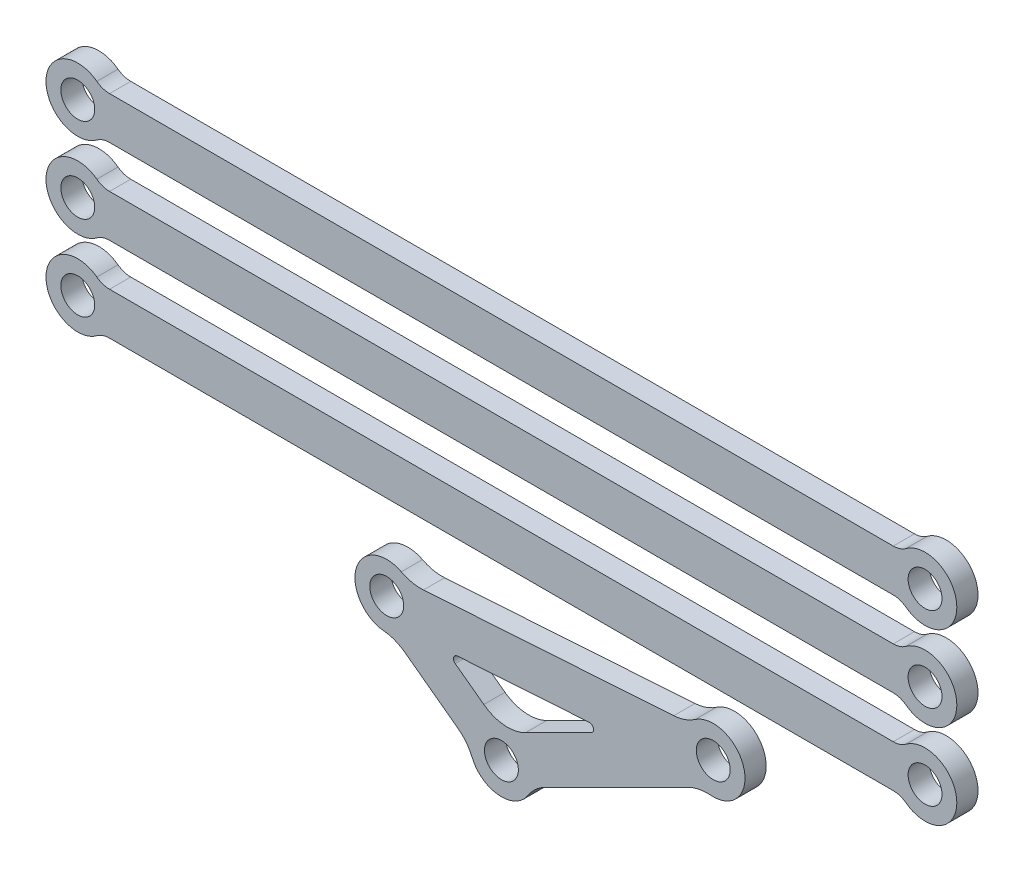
ISO-10303-21;
HEADER;
FILE_DESCRIPTION(('STEP AP214'),'2;1');
FILE_NAME('part.step','',(''),(''),'','','');
FILE_SCHEMA(('AUTOMOTIVE_DESIGN { 1 0 10303 214 1 1 1 1 }'));
ENDSEC;
DATA;
#1=APPLICATION_CONTEXT('core data for automotive mechanical design processes');
#2=APPLICATION_PROTOCOL_DEFINITION('international standard','automotive_design',2000,#1);
#3=PRODUCT_CONTEXT('',#1,'mechanical');
#4=PRODUCT('Part','Part','',(#3));
#5=PRODUCT_RELATED_PRODUCT_CATEGORY('part','',(#4));
#6=PRODUCT_DEFINITION_FORMATION('','',#4);
#7=PRODUCT_DEFINITION_CONTEXT('part definition',#1,'design');
#8=PRODUCT_DEFINITION('design','',#6,#7);
#9=PRODUCT_DEFINITION_SHAPE('','',#8);
#10=(LENGTH_UNIT() NAMED_UNIT(*) SI_UNIT(.MILLI.,.METRE.));
#11=(NAMED_UNIT(*) PLANE_ANGLE_UNIT() SI_UNIT($,.RADIAN.));
#12=(NAMED_UNIT(*) SI_UNIT($,.STERADIAN.) SOLID_ANGLE_UNIT());
#13=UNCERTAINTY_MEASURE_WITH_UNIT(LENGTH_MEASURE(1.E-05),#10,'distance_accuracy_value','');
#14=(GEOMETRIC_REPRESENTATION_CONTEXT(3) GLOBAL_UNCERTAINTY_ASSIGNED_CONTEXT((#13)) GLOBAL_UNIT_ASSIGNED_CONTEXT((#10,
#11,#12)) REPRESENTATION_CONTEXT('',''));
#15=CARTESIAN_POINT('',(0.,0.,0.));
#16=DIRECTION('',(0.,0.,1.));
#17=DIRECTION('',(1.,0.,0.));
#18=AXIS2_PLACEMENT_3D('',#15,#16,#17);
#19=CARTESIAN_POINT('',(-19.047185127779,-29.4479163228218,2.5));
#20=DIRECTION('',(0.,0.,1.));
#21=DIRECTION('',(1.,0.,0.));
#22=AXIS2_PLACEMENT_3D('',#19,#20,#21);
#23=PLANE('',#22);
#24=CARTESIAN_POINT('',(50.,-40.,2.5));
#25=DIRECTION('',(0.,0.,1.));
#26=DIRECTION('',(1.,0.,0.));
#27=AXIS2_PLACEMENT_3D('',#24,#25,#26);
#28=CIRCLE('',#27,4.);
#29=CARTESIAN_POINT('',(54.,-40.,2.5));
#30=VERTEX_POINT('',#29);
#31=EDGE_CURVE('E230',#30,#30,#28,.T.);
#32=ORIENTED_EDGE('',*,*,#31,.F.);
#33=EDGE_LOOP('',(#32));
#34=FACE_BOUND('',#33,.T.);
#35=CARTESIAN_POINT('',(-19.047185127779,-29.4479163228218,2.5));
#36=DIRECTION('',(0.,0.,-1.));
#37=DIRECTION('',(1.,0.,0.));
#38=AXIS2_PLACEMENT_3D('',#35,#36,#37);
#39=CIRCLE('',#38,10.);
#40=CARTESIAN_POINT('',(-18.3997941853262,-39.4269385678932,2.5));
#41=VERTEX_POINT('',#40);
#42=CARTESIAN_POINT('',(-23.632260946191,-38.3348212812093,2.5));
#43=VERTEX_POINT('',#42);
#44=EDGE_CURVE('E242',#41,#43,#39,.T.);
#45=ORIENTED_EDGE('',*,*,#44,.T.);
#46=CARTESIAN_POINT('',(-27.07106781,-45.,2.5));
#47=DIRECTION('',(0.,0.,1.));
#48=DIRECTION('',(1.,0.,0.));
#49=AXIS2_PLACEMENT_3D('',#46,#47,#48);
#50=CIRCLE('',#49,7.50000000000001);
#51=CARTESIAN_POINT('',(-27.7839334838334,-52.4660446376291,2.5));
#52=VERTEX_POINT('',#51);
#53=EDGE_CURVE('E245',#43,#52,#50,.T.);
#54=ORIENTED_EDGE('',*,*,#53,.T.);
#55=CARTESIAN_POINT('',(-28.7344210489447,-62.4207708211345,2.5));
#56=DIRECTION('',(0.,0.,-1.));
#57=DIRECTION('',(-1.,0.,0.));
#58=AXIS2_PLACEMENT_3D('',#55,#56,#57);
#59=CIRCLE('',#58,10.);
#60=CARTESIAN_POINT('',(-22.7922494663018,-54.3777243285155,2.5));
#61=VERTEX_POINT('',#60);
#62=EDGE_CURVE('E248',#52,#61,#59,.T.);
#63=ORIENTED_EDGE('',*,*,#62,.T.);
#64=DIRECTION('',(0.804304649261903,-0.594217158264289,0.));
#65=VECTOR('',#64,1.);
#66=CARTESIAN_POINT('',(-10.2209899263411,-63.6653221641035,2.5));
#67=LINE('',#66,#65);
#68=CARTESIAN_POINT('',(-10.2209899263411,-63.6653221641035,2.5));
#69=VERTEX_POINT('',#68);
#70=EDGE_CURVE('E250',#61,#69,#67,.T.);
#71=ORIENTED_EDGE('',*,*,#70,.T.);
#72=CARTESIAN_POINT('',(-16.163161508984,-71.7083686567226,2.5));
#73=DIRECTION('',(0.,0.,-1.));
#74=DIRECTION('',(1.,0.,0.));
#75=AXIS2_PLACEMENT_3D('',#72,#73,#74);
#76=CIRCLE('',#75,10.);
#77=CARTESIAN_POINT('',(-6.92706921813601,-67.8750151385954,2.5));
#78=VERTEX_POINT('',#77);
#79=EDGE_CURVE('E252',#69,#78,#76,.T.);
#80=ORIENTED_EDGE('',*,*,#79,.T.);
#81=CARTESIAN_POINT('',(0.,-65.,2.5));
#82=DIRECTION('',(0.,0.,1.));
#83=DIRECTION('',(1.,0.,0.));
#84=AXIS2_PLACEMENT_3D('',#81,#82,#83);
#85=CIRCLE('',#84,7.5);
#86=CARTESIAN_POINT('',(6.3301978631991,-69.0222624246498,2.5));
#87=VERTEX_POINT('',#86);
#88=EDGE_CURVE('E254',#78,#87,#85,.T.);
#89=ORIENTED_EDGE('',*,*,#88,.T.);
#90=CARTESIAN_POINT('',(14.7704616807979,-74.3852789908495,2.5));
#91=DIRECTION('',(0.,0.,-1.));
#92=DIRECTION('',(-1.,0.,0.));
#93=AXIS2_PLACEMENT_3D('',#90,#91,#92);
#94=CIRCLE('',#93,10.);
#95=CARTESIAN_POINT('',(10.2983257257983,-65.4410070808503,2.5));
#96=VERTEX_POINT('',#95);
#97=EDGE_CURVE('E256',#87,#96,#94,.T.);
#98=ORIENTED_EDGE('',*,*,#97,.T.);
#99=DIRECTION('',(0.894427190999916,0.447213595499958,0.));
#100=VECTOR('',#99,1.);
#101=CARTESIAN_POINT('',(44.1738102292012,-48.5032648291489,2.5));
#102=LINE('',#101,#100);
#103=CARTESIAN_POINT('',(44.1738102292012,-48.5032648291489,2.5));
#104=VERTEX_POINT('',#103);
#105=EDGE_CURVE('E258',#96,#104,#102,.T.);
#106=ORIENTED_EDGE('',*,*,#105,.T.);
#107=CARTESIAN_POINT('',(48.6459461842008,-57.447536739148,2.5));
#108=DIRECTION('',(0.,0.,-1.));
#109=DIRECTION('',(1.,0.,0.));
#110=AXIS2_PLACEMENT_3D('',#107,#108,#109);
#111=CIRCLE('',#110,10.);
#112=CARTESIAN_POINT('',(49.4196912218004,-47.4775157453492,2.5));
#113=VERTEX_POINT('',#112);
#114=EDGE_CURVE('E260',#104,#113,#111,.T.);
#115=ORIENTED_EDGE('',*,*,#114,.T.);
#116=CARTESIAN_POINT('',(50.,-40.,2.5));
#117=DIRECTION('',(0.,0.,1.));
#118=DIRECTION('',(1.,0.,0.));
#119=AXIS2_PLACEMENT_3D('',#116,#117,#118);
#120=CIRCLE('',#119,7.5);
#121=CARTESIAN_POINT('',(45.7288333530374,-33.8350072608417,2.5));
#122=VERTEX_POINT('',#121);
#123=EDGE_CURVE('E262',#113,#122,#120,.T.);
#124=ORIENTED_EDGE('',*,*,#123,.T.);
#125=CARTESIAN_POINT('',(40.0339444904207,-25.615016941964,2.5));
#126=DIRECTION('',(0.,0.,-1.));
#127=DIRECTION('',(-1.,0.,0.));
#128=AXIS2_PLACEMENT_3D('',#125,#126,#127);
#129=CIRCLE('',#128,10.);
#130=CARTESIAN_POINT('',(40.6813354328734,-35.5940391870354,2.5));
#131=VERTEX_POINT('',#130);
#132=EDGE_CURVE('E264',#122,#131,#129,.T.);
#133=ORIENTED_EDGE('',*,*,#132,.T.);
#134=DIRECTION('',(-0.997902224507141,-0.0647390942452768,0.));
#135=VECTOR('',#134,1.);
#136=CARTESIAN_POINT('',(-18.3997941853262,-39.4269385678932,2.5));
#137=LINE('',#136,#135);
#138=EDGE_CURVE('E266',#131,#41,#137,.T.);
#139=ORIENTED_EDGE('',*,*,#138,.T.);
#140=EDGE_LOOP('',(#45,#54,#63,#71,#80,#89,#98,#106,#115,#124,#133,#139));
#141=FACE_BOUND('',#140,.T.);
#142=CARTESIAN_POINT('',(0.,-65.,2.5));
#143=DIRECTION('',(0.,0.,1.));
#144=DIRECTION('',(1.,0.,0.));
#145=AXIS2_PLACEMENT_3D('',#142,#143,#144);
#146=CIRCLE('',#145,4.);
#147=CARTESIAN_POINT('',(4.,-65.,2.5));
#148=VERTEX_POINT('',#147);
#149=EDGE_CURVE('E236',#148,#148,#146,.T.);
#150=ORIENTED_EDGE('',*,*,#149,.F.);
#151=EDGE_LOOP('',(#150));
#152=FACE_BOUND('',#151,.T.);
#153=CARTESIAN_POINT('',(-27.07106781,-45.,2.5));
#154=DIRECTION('',(0.,0.,1.));
#155=DIRECTION('',(1.,0.,0.));
#156=AXIS2_PLACEMENT_3D('',#153,#154,#155);
#157=CIRCLE('',#156,4.);
#158=CARTESIAN_POINT('',(-23.07106781,-45.,2.5));
#159=VERTEX_POINT('',#158);
#160=EDGE_CURVE('E224',#159,#159,#157,.T.);
#161=ORIENTED_EDGE('',*,*,#160,.F.);
#162=EDGE_LOOP('',(#161));
#163=FACE_BOUND('',#162,.T.);
#164=DIRECTION('',(0.894427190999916,0.447213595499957,0.));
#165=VECTOR('',#164,1.);
#166=CARTESIAN_POINT('',(5.68953248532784,-56.5650638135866,2.5));
#167=LINE('',#166,#165);
#168=CARTESIAN_POINT('',(5.68953248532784,-56.5650638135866,2.5));
#169=VERTEX_POINT('',#168);
#170=CARTESIAN_POINT('',(21.2123442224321,-48.8036579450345,2.5));
#171=VERTEX_POINT('',#170);
#172=EDGE_CURVE('E181',#169,#171,#167,.T.);
#173=ORIENTED_EDGE('',*,*,#172,.F.);
#174=CARTESIAN_POINT('',(1.46167100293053,-48.1093408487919,2.5));
#175=DIRECTION('',(0.,0.,1.));
#176=DIRECTION('',(1.,0.,0.));
#177=AXIS2_PLACEMENT_3D('',#174,#175,#176);
#178=CIRCLE('',#177,9.45378567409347);
#179=CARTESIAN_POINT('',(-4.15593065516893,-55.7130646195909,2.5));
#180=VERTEX_POINT('',#179);
#181=EDGE_CURVE('E173',#180,#169,#178,.T.);
#182=ORIENTED_EDGE('',*,*,#181,.F.);
#183=DIRECTION('',(0.804304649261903,-0.594217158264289,0.));
#184=VECTOR('',#183,1.);
#185=CARTESIAN_POINT('',(-10.9016245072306,-50.7293721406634,2.5));
#186=LINE('',#185,#184);
#187=CARTESIAN_POINT('',(-10.9016245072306,-50.7293721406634,2.5));
#188=VERTEX_POINT('',#187);
#189=EDGE_CURVE('E202',#188,#180,#186,.T.);
#190=ORIENTED_EDGE('',*,*,#189,.F.);
#191=CARTESIAN_POINT('',(-10.3074073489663,-49.9250674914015,2.5));
#192=DIRECTION('',(0.,0.,1.));
#193=DIRECTION('',(1.,0.,0.));
#194=AXIS2_PLACEMENT_3D('',#191,#192,#193);
#195=CIRCLE('',#194,0.999999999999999);
#196=CARTESIAN_POINT('',(-10.3721464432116,-48.9271652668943,2.5));
#197=VERTEX_POINT('',#196);
#198=EDGE_CURVE('E200',#197,#188,#195,.T.);
#199=ORIENTED_EDGE('',*,*,#198,.F.);
#200=DIRECTION('',(-0.997902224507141,-0.0647390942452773,0.));
#201=VECTOR('',#200,1.);
#202=CARTESIAN_POINT('',(-10.3721464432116,-48.9271652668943,2.5));
#203=LINE('',#202,#201);
#204=CARTESIAN_POINT('',(20.7003915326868,-46.9113285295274,2.5));
#205=VERTEX_POINT('',#204);
#206=EDGE_CURVE('E196',#205,#197,#203,.T.);
#207=ORIENTED_EDGE('',*,*,#206,.F.);
#208=CARTESIAN_POINT('',(20.7651306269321,-47.9092307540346,2.5));
#209=DIRECTION('',(0.,0.,1.));
#210=DIRECTION('',(-1.,0.,0.));
#211=AXIS2_PLACEMENT_3D('',#208,#209,#210);
#212=CIRCLE('',#211,1.00000000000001);
#213=EDGE_CURVE('E194',#171,#205,#212,.T.);
#214=ORIENTED_EDGE('',*,*,#213,.F.);
#215=EDGE_LOOP('',(#173,#182,#190,#199,#207,#214));
#216=FACE_BOUND('',#215,.T.);
#217=ADVANCED_FACE('F48',(#34,#141,#152,#163,#216),#23,.T.);
#218=CARTESIAN_POINT('',(-19.047185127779,-29.4479163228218,-2.5));
#219=DIRECTION('',(0.,0.,1.));
#220=DIRECTION('',(1.,0.,0.));
#221=AXIS2_PLACEMENT_3D('',#218,#219,#220);
#222=PLANE('',#221);
#223=CARTESIAN_POINT('',(-27.07106781,-45.,-2.5));
#224=DIRECTION('',(0.,0.,1.));
#225=DIRECTION('',(1.,0.,0.));
#226=AXIS2_PLACEMENT_3D('',#223,#224,#225);
#227=CIRCLE('',#226,4.);
#228=CARTESIAN_POINT('',(-23.07106781,-45.,-2.5));
#229=VERTEX_POINT('',#228);
#230=EDGE_CURVE('E189',#229,#229,#227,.T.);
#231=ORIENTED_EDGE('',*,*,#230,.T.);
#232=EDGE_LOOP('',(#231));
#233=FACE_BOUND('',#232,.T.);
#234=CARTESIAN_POINT('',(50.,-40.,-2.5));
#235=DIRECTION('',(0.,0.,1.));
#236=DIRECTION('',(1.,0.,0.));
#237=AXIS2_PLACEMENT_3D('',#234,#235,#236);
#238=CIRCLE('',#237,4.);
#239=CARTESIAN_POINT('',(54.,-40.,-2.5));
#240=VERTEX_POINT('',#239);
#241=EDGE_CURVE('E227',#240,#240,#238,.T.);
#242=ORIENTED_EDGE('',*,*,#241,.T.);
#243=EDGE_LOOP('',(#242));
#244=FACE_BOUND('',#243,.T.);
#245=CARTESIAN_POINT('',(0.,-65.,-2.5));
#246=DIRECTION('',(0.,0.,1.));
#247=DIRECTION('',(1.,0.,0.));
#248=AXIS2_PLACEMENT_3D('',#245,#246,#247);
#249=CIRCLE('',#248,4.);
#250=CARTESIAN_POINT('',(4.,-65.,-2.5));
#251=VERTEX_POINT('',#250);
#252=EDGE_CURVE('E233',#251,#251,#249,.T.);
#253=ORIENTED_EDGE('',*,*,#252,.T.);
#254=EDGE_LOOP('',(#253));
#255=FACE_BOUND('',#254,.T.);
#256=CARTESIAN_POINT('',(-19.047185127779,-29.4479163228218,-2.5));
#257=DIRECTION('',(0.,0.,-1.));
#258=DIRECTION('',(1.,0.,0.));
#259=AXIS2_PLACEMENT_3D('',#256,#257,#258);
#260=CIRCLE('',#259,10.);
#261=CARTESIAN_POINT('',(-18.3997941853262,-39.4269385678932,-2.5));
#262=VERTEX_POINT('',#261);
#263=CARTESIAN_POINT('',(-23.632260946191,-38.3348212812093,-2.5));
#264=VERTEX_POINT('',#263);
#265=EDGE_CURVE('E239',#262,#264,#260,.T.);
#266=ORIENTED_EDGE('',*,*,#265,.F.);
#267=DIRECTION('',(-0.997902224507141,-0.0647390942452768,0.));
#268=VECTOR('',#267,1.);
#269=CARTESIAN_POINT('',(-18.3997941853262,-39.4269385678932,-2.5));
#270=LINE('',#269,#268);
#271=CARTESIAN_POINT('',(40.6813354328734,-35.5940391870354,-2.5));
#272=VERTEX_POINT('',#271);
#273=EDGE_CURVE('E246',#272,#262,#270,.T.);
#274=ORIENTED_EDGE('',*,*,#273,.F.);
#275=CARTESIAN_POINT('',(40.0339444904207,-25.615016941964,-2.5));
#276=DIRECTION('',(0.,0.,-1.));
#277=DIRECTION('',(-1.,0.,0.));
#278=AXIS2_PLACEMENT_3D('',#275,#276,#277);
#279=CIRCLE('',#278,10.);
#280=CARTESIAN_POINT('',(45.7288333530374,-33.8350072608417,-2.5));
#281=VERTEX_POINT('',#280);
#282=EDGE_CURVE('E289',#281,#272,#279,.T.);
#283=ORIENTED_EDGE('',*,*,#282,.F.);
#284=CARTESIAN_POINT('',(50.,-40.,-2.5));
#285=DIRECTION('',(0.,0.,1.));
#286=DIRECTION('',(1.,0.,0.));
#287=AXIS2_PLACEMENT_3D('',#284,#285,#286);
#288=CIRCLE('',#287,7.5);
#289=CARTESIAN_POINT('',(49.4196912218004,-47.4775157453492,-2.5));
#290=VERTEX_POINT('',#289);
#291=EDGE_CURVE('E287',#290,#281,#288,.T.);
#292=ORIENTED_EDGE('',*,*,#291,.F.);
#293=CARTESIAN_POINT('',(48.6459461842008,-57.447536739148,-2.5));
#294=DIRECTION('',(0.,0.,-1.));
#295=DIRECTION('',(1.,0.,0.));
#296=AXIS2_PLACEMENT_3D('',#293,#294,#295);
#297=CIRCLE('',#296,10.);
#298=CARTESIAN_POINT('',(44.1738102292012,-48.5032648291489,-2.5));
#299=VERTEX_POINT('',#298);
#300=EDGE_CURVE('E285',#299,#290,#297,.T.);
#301=ORIENTED_EDGE('',*,*,#300,.F.);
#302=DIRECTION('',(0.894427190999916,0.447213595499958,0.));
#303=VECTOR('',#302,1.);
#304=CARTESIAN_POINT('',(44.1738102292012,-48.5032648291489,-2.5));
#305=LINE('',#304,#303);
#306=CARTESIAN_POINT('',(10.2983257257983,-65.4410070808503,-2.5));
#307=VERTEX_POINT('',#306);
#308=EDGE_CURVE('E283',#307,#299,#305,.T.);
#309=ORIENTED_EDGE('',*,*,#308,.F.);
#310=CARTESIAN_POINT('',(14.7704616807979,-74.3852789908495,-2.5));
#311=DIRECTION('',(0.,0.,-1.));
#312=DIRECTION('',(-1.,0.,0.));
#313=AXIS2_PLACEMENT_3D('',#310,#311,#312);
#314=CIRCLE('',#313,10.);
#315=CARTESIAN_POINT('',(6.3301978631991,-69.0222624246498,-2.5));
#316=VERTEX_POINT('',#315);
#317=EDGE_CURVE('E281',#316,#307,#314,.T.);
#318=ORIENTED_EDGE('',*,*,#317,.F.);
#319=CARTESIAN_POINT('',(0.,-65.,-2.5));
#320=DIRECTION('',(0.,0.,1.));
#321=DIRECTION('',(1.,0.,0.));
#322=AXIS2_PLACEMENT_3D('',#319,#320,#321);
#323=CIRCLE('',#322,7.5);
#324=CARTESIAN_POINT('',(-6.92706921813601,-67.8750151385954,-2.5));
#325=VERTEX_POINT('',#324);
#326=EDGE_CURVE('E279',#325,#316,#323,.T.);
#327=ORIENTED_EDGE('',*,*,#326,.F.);
#328=CARTESIAN_POINT('',(-16.163161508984,-71.7083686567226,-2.5));
#329=DIRECTION('',(0.,0.,-1.));
#330=DIRECTION('',(1.,0.,0.));
#331=AXIS2_PLACEMENT_3D('',#328,#329,#330);
#332=CIRCLE('',#331,10.);
#333=CARTESIAN_POINT('',(-10.2209899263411,-63.6653221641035,-2.5));
#334=VERTEX_POINT('',#333);
#335=EDGE_CURVE('E277',#334,#325,#332,.T.);
#336=ORIENTED_EDGE('',*,*,#335,.F.);
#337=DIRECTION('',(0.804304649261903,-0.594217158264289,0.));
#338=VECTOR('',#337,1.);
#339=CARTESIAN_POINT('',(-10.2209899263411,-63.6653221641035,-2.5));
#340=LINE('',#339,#338);
#341=CARTESIAN_POINT('',(-22.7922494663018,-54.3777243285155,-2.5));
#342=VERTEX_POINT('',#341);
#343=EDGE_CURVE('E275',#342,#334,#340,.T.);
#344=ORIENTED_EDGE('',*,*,#343,.F.);
#345=CARTESIAN_POINT('',(-28.7344210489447,-62.4207708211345,-2.5));
#346=DIRECTION('',(0.,0.,-1.));
#347=DIRECTION('',(-1.,0.,0.));
#348=AXIS2_PLACEMENT_3D('',#345,#346,#347);
#349=CIRCLE('',#348,10.);
#350=CARTESIAN_POINT('',(-27.7839334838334,-52.4660446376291,-2.5));
#351=VERTEX_POINT('',#350);
#352=EDGE_CURVE('E273',#351,#342,#349,.T.);
#353=ORIENTED_EDGE('',*,*,#352,.F.);
#354=CARTESIAN_POINT('',(-27.07106781,-45.,-2.5));
#355=DIRECTION('',(0.,0.,1.));
#356=DIRECTION('',(1.,0.,0.));
#357=AXIS2_PLACEMENT_3D('',#354,#355,#356);
#358=CIRCLE('',#357,7.50000000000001);
#359=EDGE_CURVE('E271',#264,#351,#358,.T.);
#360=ORIENTED_EDGE('',*,*,#359,.F.);
#361=EDGE_LOOP('',(#266,#274,#283,#292,#301,#309,#318,#327,#336,#344,#353,#360));
#362=FACE_BOUND('',#361,.T.);
#363=CARTESIAN_POINT('',(1.46167100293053,-48.1093408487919,-2.5));
#364=DIRECTION('',(0.,0.,1.));
#365=DIRECTION('',(1.,0.,0.));
#366=AXIS2_PLACEMENT_3D('',#363,#364,#365);
#367=CIRCLE('',#366,9.45378567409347);
#368=CARTESIAN_POINT('',(-4.15593065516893,-55.7130646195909,-2.5));
#369=VERTEX_POINT('',#368);
#370=CARTESIAN_POINT('',(5.68953248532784,-56.5650638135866,-2.5));
#371=VERTEX_POINT('',#370);
#372=EDGE_CURVE('E71',#369,#371,#367,.T.);
#373=ORIENTED_EDGE('',*,*,#372,.T.);
#374=DIRECTION('',(0.894427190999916,0.447213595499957,0.));
#375=VECTOR('',#374,1.);
#376=CARTESIAN_POINT('',(5.68953248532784,-56.5650638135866,-2.5));
#377=LINE('',#376,#375);
#378=CARTESIAN_POINT('',(21.2123442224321,-48.8036579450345,-2.5));
#379=VERTEX_POINT('',#378);
#380=EDGE_CURVE('E188',#371,#379,#377,.T.);
#381=ORIENTED_EDGE('',*,*,#380,.T.);
#382=CARTESIAN_POINT('',(20.7651306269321,-47.9092307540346,-2.5));
#383=DIRECTION('',(0.,0.,1.));
#384=DIRECTION('',(-1.,0.,0.));
#385=AXIS2_PLACEMENT_3D('',#382,#383,#384);
#386=CIRCLE('',#385,1.00000000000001);
#387=CARTESIAN_POINT('',(20.7003915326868,-46.9113285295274,-2.5));
#388=VERTEX_POINT('',#387);
#389=EDGE_CURVE('E206',#379,#388,#386,.T.);
#390=ORIENTED_EDGE('',*,*,#389,.T.);
#391=DIRECTION('',(-0.997902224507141,-0.0647390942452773,0.));
#392=VECTOR('',#391,1.);
#393=CARTESIAN_POINT('',(-10.3721464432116,-48.9271652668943,-2.5));
#394=LINE('',#393,#392);
#395=CARTESIAN_POINT('',(-10.3721464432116,-48.9271652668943,-2.5));
#396=VERTEX_POINT('',#395);
#397=EDGE_CURVE('E209',#388,#396,#394,.T.);
#398=ORIENTED_EDGE('',*,*,#397,.T.);
#399=CARTESIAN_POINT('',(-10.3074073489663,-49.9250674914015,-2.5));
#400=DIRECTION('',(0.,0.,1.));
#401=DIRECTION('',(1.,0.,0.));
#402=AXIS2_PLACEMENT_3D('',#399,#400,#401);
#403=CIRCLE('',#402,0.999999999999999);
#404=CARTESIAN_POINT('',(-10.9016245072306,-50.7293721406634,-2.5));
#405=VERTEX_POINT('',#404);
#406=EDGE_CURVE('E212',#396,#405,#403,.T.);
#407=ORIENTED_EDGE('',*,*,#406,.T.);
#408=DIRECTION('',(0.804304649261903,-0.594217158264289,0.));
#409=VECTOR('',#408,1.);
#410=CARTESIAN_POINT('',(-10.9016245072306,-50.7293721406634,-2.5));
#411=LINE('',#410,#409);
#412=EDGE_CURVE('E182',#405,#369,#411,.T.);
#413=ORIENTED_EDGE('',*,*,#412,.T.);
#414=EDGE_LOOP('',(#373,#381,#390,#398,#407,#413));
#415=FACE_BOUND('',#414,.T.);
#416=ADVANCED_FACE('F331',(#233,#244,#255,#362,#415),#222,.F.);
#417=CARTESIAN_POINT('',(-19.047185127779,-29.4479163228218,2.5));
#418=DIRECTION('',(0.,0.,-1.));
#419=DIRECTION('',(-1.,0.,0.));
#420=AXIS2_PLACEMENT_3D('',#417,#418,#419);
#421=CYLINDRICAL_SURFACE('',#420,10.);
#422=ORIENTED_EDGE('',*,*,#265,.T.);
#423=DIRECTION('',(0.,0.,-1.));
#424=VECTOR('',#423,1.);
#425=CARTESIAN_POINT('',(-23.632260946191,-38.3348212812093,2.5));
#426=LINE('',#425,#424);
#427=EDGE_CURVE('E12',#43,#264,#426,.T.);
#428=ORIENTED_EDGE('',*,*,#427,.F.);
#429=ORIENTED_EDGE('',*,*,#44,.F.);
#430=DIRECTION('',(0.,0.,-1.));
#431=VECTOR('',#430,1.);
#432=CARTESIAN_POINT('',(-18.3997941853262,-39.4269385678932,2.5));
#433=LINE('',#432,#431);
#434=EDGE_CURVE('E268',#41,#262,#433,.T.);
#435=ORIENTED_EDGE('',*,*,#434,.T.);
#436=EDGE_LOOP('',(#422,#428,#429,#435));
#437=FACE_BOUND('',#436,.T.);
#438=ADVANCED_FACE('F50',(#437),#421,.F.);
#439=CARTESIAN_POINT('',(-27.07106781,-45.,2.5));
#440=DIRECTION('',(0.,0.,-1.));
#441=DIRECTION('',(-1.,0.,0.));
#442=AXIS2_PLACEMENT_3D('',#439,#440,#441);
#443=CYLINDRICAL_SURFACE('',#442,7.50000000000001);
#444=ORIENTED_EDGE('',*,*,#359,.T.);
#445=DIRECTION('',(0.,0.,-1.));
#446=VECTOR('',#445,1.);
#447=CARTESIAN_POINT('',(-27.7839334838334,-52.4660446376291,2.5));
#448=LINE('',#447,#446);
#449=EDGE_CURVE('E56',#52,#351,#448,.T.);
#450=ORIENTED_EDGE('',*,*,#449,.F.);
#451=ORIENTED_EDGE('',*,*,#53,.F.);
#452=ORIENTED_EDGE('',*,*,#427,.T.);
#453=EDGE_LOOP('',(#444,#450,#451,#452));
#454=FACE_BOUND('',#453,.T.);
#455=ADVANCED_FACE('F349',(#454),#443,.T.);
#456=CARTESIAN_POINT('',(-28.7344210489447,-62.4207708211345,2.5));
#457=DIRECTION('',(0.,0.,-1.));
#458=DIRECTION('',(-1.,0.,0.));
#459=AXIS2_PLACEMENT_3D('',#456,#457,#458);
#460=CYLINDRICAL_SURFACE('',#459,10.);
#461=ORIENTED_EDGE('',*,*,#352,.T.);
#462=DIRECTION('',(0.,0.,-1.));
#463=VECTOR('',#462,1.);
#464=CARTESIAN_POINT('',(-22.7922494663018,-54.3777243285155,2.5));
#465=LINE('',#464,#463);
#466=EDGE_CURVE('E318',#61,#342,#465,.T.);
#467=ORIENTED_EDGE('',*,*,#466,.F.);
#468=ORIENTED_EDGE('',*,*,#62,.F.);
#469=ORIENTED_EDGE('',*,*,#449,.T.);
#470=EDGE_LOOP('',(#461,#467,#468,#469));
#471=FACE_BOUND('',#470,.T.);
#472=ADVANCED_FACE('F325',(#471),#460,.F.);
#473=CARTESIAN_POINT('',(-10.2209899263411,-63.6653221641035,2.5));
#474=DIRECTION('',(0.594217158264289,0.804304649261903,0.));
#475=DIRECTION('',(-0.804304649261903,0.594217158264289,0.));
#476=AXIS2_PLACEMENT_3D('',#473,#474,#475);
#477=PLANE('',#476);
#478=ORIENTED_EDGE('',*,*,#343,.T.);
#479=DIRECTION('',(0.,0.,-1.));
#480=VECTOR('',#479,1.);
#481=CARTESIAN_POINT('',(-10.2209899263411,-63.6653221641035,2.5));
#482=LINE('',#481,#480);
#483=EDGE_CURVE('E315',#69,#334,#482,.T.);
#484=ORIENTED_EDGE('',*,*,#483,.F.);
#485=ORIENTED_EDGE('',*,*,#70,.F.);
#486=ORIENTED_EDGE('',*,*,#466,.T.);
#487=EDGE_LOOP('',(#478,#484,#485,#486));
#488=FACE_BOUND('',#487,.T.);
#489=ADVANCED_FACE('F337',(#488),#477,.F.);
#490=CARTESIAN_POINT('',(-16.163161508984,-71.7083686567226,2.5));
#491=DIRECTION('',(0.,0.,-1.));
#492=DIRECTION('',(-1.,0.,0.));
#493=AXIS2_PLACEMENT_3D('',#490,#491,#492);
#494=CYLINDRICAL_SURFACE('',#493,10.);
#495=ORIENTED_EDGE('',*,*,#335,.T.);
#496=DIRECTION('',(0.,0.,-1.));
#497=VECTOR('',#496,1.);
#498=CARTESIAN_POINT('',(-6.92706921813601,-67.8750151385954,2.5));
#499=LINE('',#498,#497);
#500=EDGE_CURVE('E312',#78,#325,#499,.T.);
#501=ORIENTED_EDGE('',*,*,#500,.F.);
#502=ORIENTED_EDGE('',*,*,#79,.F.);
#503=ORIENTED_EDGE('',*,*,#483,.T.);
#504=EDGE_LOOP('',(#495,#501,#502,#503));
#505=FACE_BOUND('',#504,.T.);
#506=ADVANCED_FACE('F341',(#505),#494,.F.);
#507=CARTESIAN_POINT('',(0.,-65.,2.5));
#508=DIRECTION('',(0.,0.,-1.));
#509=DIRECTION('',(-1.,0.,0.));
#510=AXIS2_PLACEMENT_3D('',#507,#508,#509);
#511=CYLINDRICAL_SURFACE('',#510,7.5);
#512=ORIENTED_EDGE('',*,*,#326,.T.);
#513=DIRECTION('',(0.,0.,-1.));
#514=VECTOR('',#513,1.);
#515=CARTESIAN_POINT('',(6.3301978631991,-69.0222624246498,2.5));
#516=LINE('',#515,#514);
#517=EDGE_CURVE('E309',#87,#316,#516,.T.);
#518=ORIENTED_EDGE('',*,*,#517,.F.);
#519=ORIENTED_EDGE('',*,*,#88,.F.);
#520=ORIENTED_EDGE('',*,*,#500,.T.);
#521=EDGE_LOOP('',(#512,#518,#519,#520));
#522=FACE_BOUND('',#521,.T.);
#523=ADVANCED_FACE('F382',(#522),#511,.T.);
#524=CARTESIAN_POINT('',(14.7704616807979,-74.3852789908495,2.5));
#525=DIRECTION('',(0.,0.,-1.));
#526=DIRECTION('',(-1.,0.,0.));
#527=AXIS2_PLACEMENT_3D('',#524,#525,#526);
#528=CYLINDRICAL_SURFACE('',#527,10.);
#529=ORIENTED_EDGE('',*,*,#317,.T.);
#530=DIRECTION('',(0.,0.,-1.));
#531=VECTOR('',#530,1.);
#532=CARTESIAN_POINT('',(10.2983257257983,-65.4410070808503,2.5));
#533=LINE('',#532,#531);
#534=EDGE_CURVE('E306',#96,#307,#533,.T.);
#535=ORIENTED_EDGE('',*,*,#534,.F.);
#536=ORIENTED_EDGE('',*,*,#97,.F.);
#537=ORIENTED_EDGE('',*,*,#517,.T.);
#538=EDGE_LOOP('',(#529,#535,#536,#537));
#539=FACE_BOUND('',#538,.T.);
#540=ADVANCED_FACE('F380',(#539),#528,.F.);
#541=CARTESIAN_POINT('',(44.1738102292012,-48.5032648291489,2.5));
#542=DIRECTION('',(-0.447213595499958,0.894427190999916,0.));
#543=DIRECTION('',(-0.894427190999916,-0.447213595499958,0.));
#544=AXIS2_PLACEMENT_3D('',#541,#542,#543);
#545=PLANE('',#544);
#546=ORIENTED_EDGE('',*,*,#308,.T.);
#547=DIRECTION('',(0.,0.,-1.));
#548=VECTOR('',#547,1.);
#549=CARTESIAN_POINT('',(44.1738102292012,-48.5032648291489,2.5));
#550=LINE('',#549,#548);
#551=EDGE_CURVE('E303',#104,#299,#550,.T.);
#552=ORIENTED_EDGE('',*,*,#551,.F.);
#553=ORIENTED_EDGE('',*,*,#105,.F.);
#554=ORIENTED_EDGE('',*,*,#534,.T.);
#555=EDGE_LOOP('',(#546,#552,#553,#554));
#556=FACE_BOUND('',#555,.T.);
#557=ADVANCED_FACE('F376',(#556),#545,.F.);
#558=CARTESIAN_POINT('',(48.6459461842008,-57.447536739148,2.5));
#559=DIRECTION('',(0.,0.,-1.));
#560=DIRECTION('',(-1.,0.,0.));
#561=AXIS2_PLACEMENT_3D('',#558,#559,#560);
#562=CYLINDRICAL_SURFACE('',#561,10.);
#563=ORIENTED_EDGE('',*,*,#300,.T.);
#564=DIRECTION('',(0.,0.,-1.));
#565=VECTOR('',#564,1.);
#566=CARTESIAN_POINT('',(49.4196912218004,-47.4775157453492,2.5));
#567=LINE('',#566,#565);
#568=EDGE_CURVE('E300',#113,#290,#567,.T.);
#569=ORIENTED_EDGE('',*,*,#568,.F.);
#570=ORIENTED_EDGE('',*,*,#114,.F.);
#571=ORIENTED_EDGE('',*,*,#551,.T.);
#572=EDGE_LOOP('',(#563,#569,#570,#571));
#573=FACE_BOUND('',#572,.T.);
#574=ADVANCED_FACE('F371',(#573),#562,.F.);
#575=CARTESIAN_POINT('',(50.,-40.,2.5));
#576=DIRECTION('',(0.,0.,-1.));
#577=DIRECTION('',(-1.,0.,0.));
#578=AXIS2_PLACEMENT_3D('',#575,#576,#577);
#579=CYLINDRICAL_SURFACE('',#578,7.5);
#580=ORIENTED_EDGE('',*,*,#291,.T.);
#581=DIRECTION('',(0.,0.,-1.));
#582=VECTOR('',#581,1.);
#583=CARTESIAN_POINT('',(45.7288333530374,-33.8350072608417,2.5));
#584=LINE('',#583,#582);
#585=EDGE_CURVE('E297',#122,#281,#584,.T.);
#586=ORIENTED_EDGE('',*,*,#585,.F.);
#587=ORIENTED_EDGE('',*,*,#123,.F.);
#588=ORIENTED_EDGE('',*,*,#568,.T.);
#589=EDGE_LOOP('',(#580,#586,#587,#588));
#590=FACE_BOUND('',#589,.T.);
#591=ADVANCED_FACE('F365',(#590),#579,.T.);
#592=CARTESIAN_POINT('',(40.0339444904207,-25.615016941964,2.5));
#593=DIRECTION('',(0.,0.,-1.));
#594=DIRECTION('',(-1.,0.,0.));
#595=AXIS2_PLACEMENT_3D('',#592,#593,#594);
#596=CYLINDRICAL_SURFACE('',#595,10.);
#597=ORIENTED_EDGE('',*,*,#282,.T.);
#598=DIRECTION('',(0.,0.,-1.));
#599=VECTOR('',#598,1.);
#600=CARTESIAN_POINT('',(40.6813354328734,-35.5940391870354,2.5));
#601=LINE('',#600,#599);
#602=EDGE_CURVE('E294',#131,#272,#601,.T.);
#603=ORIENTED_EDGE('',*,*,#602,.F.);
#604=ORIENTED_EDGE('',*,*,#132,.F.);
#605=ORIENTED_EDGE('',*,*,#585,.T.);
#606=EDGE_LOOP('',(#597,#603,#604,#605));
#607=FACE_BOUND('',#606,.T.);
#608=ADVANCED_FACE('F361',(#607),#596,.F.);
#609=CARTESIAN_POINT('',(-18.3997941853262,-39.4269385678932,2.5));
#610=DIRECTION('',(0.0647390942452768,-0.997902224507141,0.));
#611=DIRECTION('',(0.997902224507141,0.0647390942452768,0.));
#612=AXIS2_PLACEMENT_3D('',#609,#610,#611);
#613=PLANE('',#612);
#614=ORIENTED_EDGE('',*,*,#273,.T.);
#615=ORIENTED_EDGE('',*,*,#434,.F.);
#616=ORIENTED_EDGE('',*,*,#138,.F.);
#617=ORIENTED_EDGE('',*,*,#602,.T.);
#618=EDGE_LOOP('',(#614,#615,#616,#617));
#619=FACE_BOUND('',#618,.T.);
#620=ADVANCED_FACE('F356',(#619),#613,.F.);
#621=CARTESIAN_POINT('',(0.,-65.,2.5));
#622=DIRECTION('',(0.,0.,-1.));
#623=DIRECTION('',(-1.,0.,0.));
#624=AXIS2_PLACEMENT_3D('',#621,#622,#623);
#625=CYLINDRICAL_SURFACE('',#624,4.);
#626=ORIENTED_EDGE('',*,*,#149,.T.);
#627=EDGE_LOOP('',(#626));
#628=FACE_BOUND('',#627,.T.);
#629=ORIENTED_EDGE('',*,*,#252,.F.);
#630=EDGE_LOOP('',(#629));
#631=FACE_BOUND('',#630,.T.);
#632=ADVANCED_FACE('F401',(#628,#631),#625,.F.);
#633=CARTESIAN_POINT('',(50.,-40.,2.5));
#634=DIRECTION('',(0.,0.,-1.));
#635=DIRECTION('',(-1.,0.,0.));
#636=AXIS2_PLACEMENT_3D('',#633,#634,#635);
#637=CYLINDRICAL_SURFACE('',#636,4.);
#638=ORIENTED_EDGE('',*,*,#31,.T.);
#639=EDGE_LOOP('',(#638));
#640=FACE_BOUND('',#639,.T.);
#641=ORIENTED_EDGE('',*,*,#241,.F.);
#642=EDGE_LOOP('',(#641));
#643=FACE_BOUND('',#642,.T.);
#644=ADVANCED_FACE('F439',(#640,#643),#637,.F.);
#645=CARTESIAN_POINT('',(-27.07106781,-45.,2.5));
#646=DIRECTION('',(0.,0.,-1.));
#647=DIRECTION('',(-1.,0.,0.));
#648=AXIS2_PLACEMENT_3D('',#645,#646,#647);
#649=CYLINDRICAL_SURFACE('',#648,4.);
#650=ORIENTED_EDGE('',*,*,#160,.T.);
#651=EDGE_LOOP('',(#650));
#652=FACE_BOUND('',#651,.T.);
#653=ORIENTED_EDGE('',*,*,#230,.F.);
#654=EDGE_LOOP('',(#653));
#655=FACE_BOUND('',#654,.T.);
#656=ADVANCED_FACE('F446',(#652,#655),#649,.F.);
#657=CARTESIAN_POINT('',(1.46167100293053,-48.1093408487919,2.5));
#658=DIRECTION('',(0.,0.,-1.));
#659=DIRECTION('',(-1.,0.,0.));
#660=AXIS2_PLACEMENT_3D('',#657,#658,#659);
#661=CYLINDRICAL_SURFACE('',#660,9.45378567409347);
#662=ORIENTED_EDGE('',*,*,#372,.F.);
#663=DIRECTION('',(0.,0.,-1.));
#664=VECTOR('',#663,1.);
#665=CARTESIAN_POINT('',(-4.15593065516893,-55.7130646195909,2.5));
#666=LINE('',#665,#664);
#667=EDGE_CURVE('E177',#180,#369,#666,.T.);
#668=ORIENTED_EDGE('',*,*,#667,.F.);
#669=ORIENTED_EDGE('',*,*,#181,.T.);
#670=DIRECTION('',(0.,0.,-1.));
#671=VECTOR('',#670,1.);
#672=CARTESIAN_POINT('',(5.68953248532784,-56.5650638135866,2.5));
#673=LINE('',#672,#671);
#674=EDGE_CURVE('E176',#169,#371,#673,.T.);
#675=ORIENTED_EDGE('',*,*,#674,.T.);
#676=EDGE_LOOP('',(#662,#668,#669,#675));
#677=FACE_BOUND('',#676,.T.);
#678=ADVANCED_FACE('F175',(#677),#661,.F.);
#679=CARTESIAN_POINT('',(5.68953248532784,-56.5650638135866,2.5));
#680=DIRECTION('',(-0.447213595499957,0.894427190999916,0.));
#681=DIRECTION('',(-0.894427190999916,-0.447213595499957,0.));
#682=AXIS2_PLACEMENT_3D('',#679,#680,#681);
#683=PLANE('',#682);
#684=ORIENTED_EDGE('',*,*,#380,.F.);
#685=ORIENTED_EDGE('',*,*,#674,.F.);
#686=ORIENTED_EDGE('',*,*,#172,.T.);
#687=DIRECTION('',(0.,0.,-1.));
#688=VECTOR('',#687,1.);
#689=CARTESIAN_POINT('',(21.2123442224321,-48.8036579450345,2.5));
#690=LINE('',#689,#688);
#691=EDGE_CURVE('E190',#171,#379,#690,.T.);
#692=ORIENTED_EDGE('',*,*,#691,.T.);
#693=EDGE_LOOP('',(#684,#685,#686,#692));
#694=FACE_BOUND('',#693,.T.);
#695=ADVANCED_FACE('F185',(#694),#683,.T.);
#696=CARTESIAN_POINT('',(20.7651306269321,-47.9092307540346,2.5));
#697=DIRECTION('',(0.,0.,-1.));
#698=DIRECTION('',(-1.,0.,0.));
#699=AXIS2_PLACEMENT_3D('',#696,#697,#698);
#700=CYLINDRICAL_SURFACE('',#699,1.00000000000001);
#701=ORIENTED_EDGE('',*,*,#389,.F.);
#702=ORIENTED_EDGE('',*,*,#691,.F.);
#703=ORIENTED_EDGE('',*,*,#213,.T.);
#704=DIRECTION('',(0.,0.,-1.));
#705=VECTOR('',#704,1.);
#706=CARTESIAN_POINT('',(20.7003915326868,-46.9113285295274,2.5));
#707=LINE('',#706,#705);
#708=EDGE_CURVE('E221',#205,#388,#707,.T.);
#709=ORIENTED_EDGE('',*,*,#708,.T.);
#710=EDGE_LOOP('',(#701,#702,#703,#709));
#711=FACE_BOUND('',#710,.T.);
#712=ADVANCED_FACE('F466',(#711),#700,.F.);
#713=CARTESIAN_POINT('',(-10.3721464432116,-48.9271652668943,2.5));
#714=DIRECTION('',(0.0647390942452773,-0.997902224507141,0.));
#715=DIRECTION('',(0.997902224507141,0.0647390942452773,0.));
#716=AXIS2_PLACEMENT_3D('',#713,#714,#715);
#717=PLANE('',#716);
#718=ORIENTED_EDGE('',*,*,#397,.F.);
#719=ORIENTED_EDGE('',*,*,#708,.F.);
#720=ORIENTED_EDGE('',*,*,#206,.T.);
#721=DIRECTION('',(0.,0.,-1.));
#722=VECTOR('',#721,1.);
#723=CARTESIAN_POINT('',(-10.3721464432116,-48.9271652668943,2.5));
#724=LINE('',#723,#722);
#725=EDGE_CURVE('E219',#197,#396,#724,.T.);
#726=ORIENTED_EDGE('',*,*,#725,.T.);
#727=EDGE_LOOP('',(#718,#719,#720,#726));
#728=FACE_BOUND('',#727,.T.);
#729=ADVANCED_FACE('F473',(#728),#717,.T.);
#730=CARTESIAN_POINT('',(-10.3074073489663,-49.9250674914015,2.5));
#731=DIRECTION('',(0.,0.,-1.));
#732=DIRECTION('',(-1.,0.,0.));
#733=AXIS2_PLACEMENT_3D('',#730,#731,#732);
#734=CYLINDRICAL_SURFACE('',#733,0.999999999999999);
#735=ORIENTED_EDGE('',*,*,#406,.F.);
#736=ORIENTED_EDGE('',*,*,#725,.F.);
#737=ORIENTED_EDGE('',*,*,#198,.T.);
#738=DIRECTION('',(0.,0.,-1.));
#739=VECTOR('',#738,1.);
#740=CARTESIAN_POINT('',(-10.9016245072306,-50.7293721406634,2.5));
#741=LINE('',#740,#739);
#742=EDGE_CURVE('E63',#188,#405,#741,.T.);
#743=ORIENTED_EDGE('',*,*,#742,.T.);
#744=EDGE_LOOP('',(#735,#736,#737,#743));
#745=FACE_BOUND('',#744,.T.);
#746=ADVANCED_FACE('F481',(#745),#734,.F.);
#747=CARTESIAN_POINT('',(-10.9016245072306,-50.7293721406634,2.5));
#748=DIRECTION('',(0.594217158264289,0.804304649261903,0.));
#749=DIRECTION('',(-0.804304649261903,0.594217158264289,0.));
#750=AXIS2_PLACEMENT_3D('',#747,#748,#749);
#751=PLANE('',#750);
#752=ORIENTED_EDGE('',*,*,#412,.F.);
#753=ORIENTED_EDGE('',*,*,#742,.F.);
#754=ORIENTED_EDGE('',*,*,#189,.T.);
#755=ORIENTED_EDGE('',*,*,#667,.T.);
#756=EDGE_LOOP('',(#752,#753,#754,#755));
#757=FACE_BOUND('',#756,.T.);
#758=ADVANCED_FACE('F489',(#757),#751,.T.);
#759=CLOSED_SHELL('',(#217,#416,#438,#455,#472,#489,#506,#523,#540,#557,#574,#591,#608,#620,
#632,#644,#656,#678,#695,#712,#729,#746,#758));
#760=MANIFOLD_SOLID_BREP('B2',#759);
#761=CARTESIAN_POINT('',(-92.5,30.,2.5));
#762=DIRECTION('',(0.,0.,1.));
#763=DIRECTION('',(1.,0.,0.));
#764=AXIS2_PLACEMENT_3D('',#761,#762,#763);
#765=PLANE('',#764);
#766=CARTESIAN_POINT('',(-100.,20.,2.5));
#767=DIRECTION('',(0.,0.,1.));
#768=DIRECTION('',(1.,0.,0.));
#769=AXIS2_PLACEMENT_3D('',#766,#767,#768);
#770=CIRCLE('',#769,4.00000000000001);
#771=CARTESIAN_POINT('',(-96.,20.,2.5));
#772=VERTEX_POINT('',#771);
#773=EDGE_CURVE('E758',#772,#772,#770,.T.);
#774=ORIENTED_EDGE('',*,*,#773,.F.);
#775=EDGE_LOOP('',(#774));
#776=FACE_BOUND('',#775,.T.);
#777=CARTESIAN_POINT('',(-92.5,30.,2.5));
#778=DIRECTION('',(0.,0.,-1.));
#779=DIRECTION('',(1.,0.,0.));
#780=AXIS2_PLACEMENT_3D('',#777,#778,#779);
#781=CIRCLE('',#780,5.);
#782=CARTESIAN_POINT('',(-92.5,25.,2.5));
#783=VERTEX_POINT('',#782);
#784=CARTESIAN_POINT('',(-95.5,26.,2.5));
#785=VERTEX_POINT('',#784);
#786=EDGE_CURVE('E769',#783,#785,#781,.T.);
#787=ORIENTED_EDGE('',*,*,#786,.T.);
#788=CARTESIAN_POINT('',(-100.,20.,2.5));
#789=DIRECTION('',(0.,0.,1.));
#790=DIRECTION('',(1.,0.,0.));
#791=AXIS2_PLACEMENT_3D('',#788,#789,#790);
#792=CIRCLE('',#791,7.5);
#793=CARTESIAN_POINT('',(-95.5,14.,2.5));
#794=VERTEX_POINT('',#793);
#795=EDGE_CURVE('E717',#785,#794,#792,.T.);
#796=ORIENTED_EDGE('',*,*,#795,.T.);
#797=CARTESIAN_POINT('',(-92.5,9.99999999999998,2.5));
#798=DIRECTION('',(0.,0.,-1.));
#799=DIRECTION('',(-1.,0.,0.));
#800=AXIS2_PLACEMENT_3D('',#797,#798,#799);
#801=CIRCLE('',#800,5.);
#802=CARTESIAN_POINT('',(-92.5,15.,2.5));
#803=VERTEX_POINT('',#802);
#804=EDGE_CURVE('E784',#794,#803,#801,.T.);
#805=ORIENTED_EDGE('',*,*,#804,.T.);
#806=DIRECTION('',(1.,0.,0.));
#807=VECTOR('',#806,1.);
#808=CARTESIAN_POINT('',(92.5,15.,2.5));
#809=LINE('',#808,#807);
#810=CARTESIAN_POINT('',(92.5,15.,2.5));
#811=VERTEX_POINT('',#810);
#812=EDGE_CURVE('E797',#803,#811,#809,.T.);
#813=ORIENTED_EDGE('',*,*,#812,.T.);
#814=CARTESIAN_POINT('',(92.5,9.99999999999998,2.5));
#815=DIRECTION('',(0.,0.,-1.));
#816=DIRECTION('',(1.,0.,0.));
#817=AXIS2_PLACEMENT_3D('',#814,#815,#816);
#818=CIRCLE('',#817,5.);
#819=CARTESIAN_POINT('',(95.5,14.,2.5));
#820=VERTEX_POINT('',#819);
#821=EDGE_CURVE('E736',#811,#820,#818,.T.);
#822=ORIENTED_EDGE('',*,*,#821,.T.);
#823=CARTESIAN_POINT('',(100.,20.,2.5));
#824=DIRECTION('',(0.,0.,1.));
#825=DIRECTION('',(-1.,0.,0.));
#826=AXIS2_PLACEMENT_3D('',#823,#824,#825);
#827=CIRCLE('',#826,7.5);
#828=CARTESIAN_POINT('',(95.5,26.,2.5));
#829=VERTEX_POINT('',#828);
#830=EDGE_CURVE('E730',#820,#829,#827,.T.);
#831=ORIENTED_EDGE('',*,*,#830,.T.);
#832=CARTESIAN_POINT('',(92.5,30.,2.5));
#833=DIRECTION('',(0.,0.,-1.));
#834=DIRECTION('',(-1.,0.,0.));
#835=AXIS2_PLACEMENT_3D('',#832,#833,#834);
#836=CIRCLE('',#835,5.);
#837=CARTESIAN_POINT('',(92.5,25.,2.5));
#838=VERTEX_POINT('',#837);
#839=EDGE_CURVE('E734',#829,#838,#836,.T.);
#840=ORIENTED_EDGE('',*,*,#839,.T.);
#841=DIRECTION('',(-1.,0.,0.));
#842=VECTOR('',#841,1.);
#843=CARTESIAN_POINT('',(-92.5,25.,2.5));
#844=LINE('',#843,#842);
#845=EDGE_CURVE('E674',#838,#783,#844,.T.);
#846=ORIENTED_EDGE('',*,*,#845,.T.);
#847=EDGE_LOOP('',(#787,#796,#805,#813,#822,#831,#840,#846));
#848=FACE_BOUND('',#847,.T.);
#849=CARTESIAN_POINT('',(100.,20.,2.5));
#850=DIRECTION('',(0.,0.,1.));
#851=DIRECTION('',(1.,0.,0.));
#852=AXIS2_PLACEMENT_3D('',#849,#850,#851);
#853=CIRCLE('',#852,4.00000000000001);
#854=CARTESIAN_POINT('',(104.,20.,2.5));
#855=VERTEX_POINT('',#854);
#856=EDGE_CURVE('E806',#855,#855,#853,.T.);
#857=ORIENTED_EDGE('',*,*,#856,.F.);
#858=EDGE_LOOP('',(#857));
#859=FACE_BOUND('',#858,.T.);
#860=ADVANCED_FACE('F657',(#776,#848,#859),#765,.T.);
#861=CARTESIAN_POINT('',(-92.5,30.,-2.5));
#862=DIRECTION('',(0.,0.,1.));
#863=DIRECTION('',(1.,0.,0.));
#864=AXIS2_PLACEMENT_3D('',#861,#862,#863);
#865=PLANE('',#864);
#866=CARTESIAN_POINT('',(-92.5,30.,-2.5));
#867=DIRECTION('',(0.,0.,-1.));
#868=DIRECTION('',(1.,0.,0.));
#869=AXIS2_PLACEMENT_3D('',#866,#867,#868);
#870=CIRCLE('',#869,5.);
#871=CARTESIAN_POINT('',(-92.5,25.,-2.5));
#872=VERTEX_POINT('',#871);
#873=CARTESIAN_POINT('',(-95.5,26.,-2.5));
#874=VERTEX_POINT('',#873);
#875=EDGE_CURVE('E754',#872,#874,#870,.T.);
#876=ORIENTED_EDGE('',*,*,#875,.F.);
#877=DIRECTION('',(-1.,0.,0.));
#878=VECTOR('',#877,1.);
#879=CARTESIAN_POINT('',(-92.5,25.,-2.5));
#880=LINE('',#879,#878);
#881=CARTESIAN_POINT('',(92.5,25.,-2.5));
#882=VERTEX_POINT('',#881);
#883=EDGE_CURVE('E709',#882,#872,#880,.T.);
#884=ORIENTED_EDGE('',*,*,#883,.F.);
#885=CARTESIAN_POINT('',(92.5,30.,-2.5));
#886=DIRECTION('',(0.,0.,-1.));
#887=DIRECTION('',(-1.,0.,0.));
#888=AXIS2_PLACEMENT_3D('',#885,#886,#887);
#889=CIRCLE('',#888,5.);
#890=CARTESIAN_POINT('',(95.5,26.,-2.5));
#891=VERTEX_POINT('',#890);
#892=EDGE_CURVE('E703',#891,#882,#889,.T.);
#893=ORIENTED_EDGE('',*,*,#892,.F.);
#894=CARTESIAN_POINT('',(100.,20.,-2.5));
#895=DIRECTION('',(0.,0.,1.));
#896=DIRECTION('',(-1.,0.,0.));
#897=AXIS2_PLACEMENT_3D('',#894,#895,#896);
#898=CIRCLE('',#897,7.5);
#899=CARTESIAN_POINT('',(95.5,14.,-2.5));
#900=VERTEX_POINT('',#899);
#901=EDGE_CURVE('E744',#900,#891,#898,.T.);
#902=ORIENTED_EDGE('',*,*,#901,.F.);
#903=CARTESIAN_POINT('',(92.5,9.99999999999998,-2.5));
#904=DIRECTION('',(0.,0.,-1.));
#905=DIRECTION('',(1.,0.,0.));
#906=AXIS2_PLACEMENT_3D('',#903,#904,#905);
#907=CIRCLE('',#906,5.);
#908=CARTESIAN_POINT('',(92.5,15.,-2.5));
#909=VERTEX_POINT('',#908);
#910=EDGE_CURVE('E764',#909,#900,#907,.T.);
#911=ORIENTED_EDGE('',*,*,#910,.F.);
#912=DIRECTION('',(1.,0.,0.));
#913=VECTOR('',#912,1.);
#914=CARTESIAN_POINT('',(92.5,15.,-2.5));
#915=LINE('',#914,#913);
#916=CARTESIAN_POINT('',(-92.5,15.,-2.5));
#917=VERTEX_POINT('',#916);
#918=EDGE_CURVE('E762',#917,#909,#915,.T.);
#919=ORIENTED_EDGE('',*,*,#918,.F.);
#920=CARTESIAN_POINT('',(-92.5,9.99999999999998,-2.5));
#921=DIRECTION('',(0.,0.,-1.));
#922=DIRECTION('',(-1.,0.,0.));
#923=AXIS2_PLACEMENT_3D('',#920,#921,#922);
#924=CIRCLE('',#923,5.);
#925=CARTESIAN_POINT('',(-95.5,14.,-2.5));
#926=VERTEX_POINT('',#925);
#927=EDGE_CURVE('E760',#926,#917,#924,.T.);
#928=ORIENTED_EDGE('',*,*,#927,.F.);
#929=CARTESIAN_POINT('',(-100.,20.,-2.5));
#930=DIRECTION('',(0.,0.,1.));
#931=DIRECTION('',(1.,0.,0.));
#932=AXIS2_PLACEMENT_3D('',#929,#930,#931);
#933=CIRCLE('',#932,7.5);
#934=EDGE_CURVE('E757',#874,#926,#933,.T.);
#935=ORIENTED_EDGE('',*,*,#934,.F.);
#936=EDGE_LOOP('',(#876,#884,#893,#902,#911,#919,#928,#935));
#937=FACE_BOUND('',#936,.T.);
#938=CARTESIAN_POINT('',(-100.,20.,-2.5));
#939=DIRECTION('',(0.,0.,1.));
#940=DIRECTION('',(1.,0.,0.));
#941=AXIS2_PLACEMENT_3D('',#938,#939,#940);
#942=CIRCLE('',#941,4.00000000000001);
#943=CARTESIAN_POINT('',(-96.,20.,-2.5));
#944=VERTEX_POINT('',#943);
#945=EDGE_CURVE('E803',#944,#944,#942,.T.);
#946=ORIENTED_EDGE('',*,*,#945,.T.);
#947=EDGE_LOOP('',(#946));
#948=FACE_BOUND('',#947,.T.);
#949=CARTESIAN_POINT('',(100.,20.,-2.5));
#950=DIRECTION('',(0.,0.,1.));
#951=DIRECTION('',(1.,0.,0.));
#952=AXIS2_PLACEMENT_3D('',#949,#950,#951);
#953=CIRCLE('',#952,4.00000000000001);
#954=CARTESIAN_POINT('',(104.,20.,-2.5));
#955=VERTEX_POINT('',#954);
#956=EDGE_CURVE('E809',#955,#955,#953,.T.);
#957=ORIENTED_EDGE('',*,*,#956,.T.);
#958=EDGE_LOOP('',(#957));
#959=FACE_BOUND('',#958,.T.);
#960=ADVANCED_FACE('F788',(#937,#948,#959),#865,.F.);
#961=CARTESIAN_POINT('',(-92.5,30.,2.5));
#962=DIRECTION('',(0.,0.,-1.));
#963=DIRECTION('',(-1.,0.,0.));
#964=AXIS2_PLACEMENT_3D('',#961,#962,#963);
#965=CYLINDRICAL_SURFACE('',#964,5.);
#966=ORIENTED_EDGE('',*,*,#875,.T.);
#967=DIRECTION('',(0.,0.,-1.));
#968=VECTOR('',#967,1.);
#969=CARTESIAN_POINT('',(-95.5,26.,2.5));
#970=LINE('',#969,#968);
#971=EDGE_CURVE('E46',#785,#874,#970,.T.);
#972=ORIENTED_EDGE('',*,*,#971,.F.);
#973=ORIENTED_EDGE('',*,*,#786,.F.);
#974=DIRECTION('',(0.,0.,-1.));
#975=VECTOR('',#974,1.);
#976=CARTESIAN_POINT('',(-92.5,25.,2.5));
#977=LINE('',#976,#975);
#978=EDGE_CURVE('E750',#783,#872,#977,.T.);
#979=ORIENTED_EDGE('',*,*,#978,.T.);
#980=EDGE_LOOP('',(#966,#972,#973,#979));
#981=FACE_BOUND('',#980,.T.);
#982=ADVANCED_FACE('F659',(#981),#965,.F.);
#983=CARTESIAN_POINT('',(-100.,20.,2.5));
#984=DIRECTION('',(0.,0.,-1.));
#985=DIRECTION('',(-1.,0.,0.));
#986=AXIS2_PLACEMENT_3D('',#983,#984,#985);
#987=CYLINDRICAL_SURFACE('',#986,7.5);
#988=ORIENTED_EDGE('',*,*,#934,.T.);
#989=DIRECTION('',(0.,0.,-1.));
#990=VECTOR('',#989,1.);
#991=CARTESIAN_POINT('',(-95.5,14.,2.5));
#992=LINE('',#991,#990);
#993=EDGE_CURVE('E666',#794,#926,#992,.T.);
#994=ORIENTED_EDGE('',*,*,#993,.F.);
#995=ORIENTED_EDGE('',*,*,#795,.F.);
#996=ORIENTED_EDGE('',*,*,#971,.T.);
#997=EDGE_LOOP('',(#988,#994,#995,#996));
#998=FACE_BOUND('',#997,.T.);
#999=ADVANCED_FACE('F841',(#998),#987,.T.);
#1000=CARTESIAN_POINT('',(-92.5,9.99999999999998,2.5));
#1001=DIRECTION('',(0.,0.,-1.));
#1002=DIRECTION('',(-1.,0.,0.));
#1003=AXIS2_PLACEMENT_3D('',#1000,#1001,#1002);
#1004=CYLINDRICAL_SURFACE('',#1003,5.);
#1005=ORIENTED_EDGE('',*,*,#927,.T.);
#1006=DIRECTION('',(0.,0.,-1.));
#1007=VECTOR('',#1006,1.);
#1008=CARTESIAN_POINT('',(-92.5,15.,2.5));
#1009=LINE('',#1008,#1007);
#1010=EDGE_CURVE('E776',#803,#917,#1009,.T.);
#1011=ORIENTED_EDGE('',*,*,#1010,.F.);
#1012=ORIENTED_EDGE('',*,*,#804,.F.);
#1013=ORIENTED_EDGE('',*,*,#993,.T.);
#1014=EDGE_LOOP('',(#1005,#1011,#1012,#1013));
#1015=FACE_BOUND('',#1014,.T.);
#1016=ADVANCED_FACE('F782',(#1015),#1004,.F.);
#1017=CARTESIAN_POINT('',(92.5,15.,2.5));
#1018=DIRECTION('',(0.,1.,0.));
#1019=DIRECTION('',(0.,0.,1.));
#1020=AXIS2_PLACEMENT_3D('',#1017,#1018,#1019);
#1021=PLANE('',#1020);
#1022=ORIENTED_EDGE('',*,*,#918,.T.);
#1023=DIRECTION('',(0.,0.,-1.));
#1024=VECTOR('',#1023,1.);
#1025=CARTESIAN_POINT('',(92.5,15.,2.5));
#1026=LINE('',#1025,#1024);
#1027=EDGE_CURVE('E773',#811,#909,#1026,.T.);
#1028=ORIENTED_EDGE('',*,*,#1027,.F.);
#1029=ORIENTED_EDGE('',*,*,#812,.F.);
#1030=ORIENTED_EDGE('',*,*,#1010,.T.);
#1031=EDGE_LOOP('',(#1022,#1028,#1029,#1030));
#1032=FACE_BOUND('',#1031,.T.);
#1033=ADVANCED_FACE('F793',(#1032),#1021,.F.);
#1034=CARTESIAN_POINT('',(92.5,9.99999999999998,2.5));
#1035=DIRECTION('',(0.,0.,-1.));
#1036=DIRECTION('',(-1.,0.,0.));
#1037=AXIS2_PLACEMENT_3D('',#1034,#1035,#1036);
#1038=CYLINDRICAL_SURFACE('',#1037,5.);
#1039=ORIENTED_EDGE('',*,*,#910,.T.);
#1040=DIRECTION('',(0.,0.,-1.));
#1041=VECTOR('',#1040,1.);
#1042=CARTESIAN_POINT('',(95.5,14.,2.5));
#1043=LINE('',#1042,#1041);
#1044=EDGE_CURVE('E745',#820,#900,#1043,.T.);
#1045=ORIENTED_EDGE('',*,*,#1044,.F.);
#1046=ORIENTED_EDGE('',*,*,#821,.F.);
#1047=ORIENTED_EDGE('',*,*,#1027,.T.);
#1048=EDGE_LOOP('',(#1039,#1045,#1046,#1047));
#1049=FACE_BOUND('',#1048,.T.);
#1050=ADVANCED_FACE('F796',(#1049),#1038,.F.);
#1051=CARTESIAN_POINT('',(100.,20.,2.5));
#1052=DIRECTION('',(0.,0.,-1.));
#1053=DIRECTION('',(-1.,0.,0.));
#1054=AXIS2_PLACEMENT_3D('',#1051,#1052,#1053);
#1055=CYLINDRICAL_SURFACE('',#1054,7.5);
#1056=ORIENTED_EDGE('',*,*,#901,.T.);
#1057=DIRECTION('',(0.,0.,-1.));
#1058=VECTOR('',#1057,1.);
#1059=CARTESIAN_POINT('',(95.5,26.,2.5));
#1060=LINE('',#1059,#1058);
#1061=EDGE_CURVE('E741',#829,#891,#1060,.T.);
#1062=ORIENTED_EDGE('',*,*,#1061,.F.);
#1063=ORIENTED_EDGE('',*,*,#830,.F.);
#1064=ORIENTED_EDGE('',*,*,#1044,.T.);
#1065=EDGE_LOOP('',(#1056,#1062,#1063,#1064));
#1066=FACE_BOUND('',#1065,.T.);
#1067=ADVANCED_FACE('F742',(#1066),#1055,.T.);
#1068=CARTESIAN_POINT('',(92.5,30.,2.5));
#1069=DIRECTION('',(0.,0.,-1.));
#1070=DIRECTION('',(-1.,0.,0.));
#1071=AXIS2_PLACEMENT_3D('',#1068,#1069,#1070);
#1072=CYLINDRICAL_SURFACE('',#1071,5.);
#1073=ORIENTED_EDGE('',*,*,#892,.T.);
#1074=DIRECTION('',(0.,0.,-1.));
#1075=VECTOR('',#1074,1.);
#1076=CARTESIAN_POINT('',(92.5,25.,2.5));
#1077=LINE('',#1076,#1075);
#1078=EDGE_CURVE('E746',#838,#882,#1077,.T.);
#1079=ORIENTED_EDGE('',*,*,#1078,.F.);
#1080=ORIENTED_EDGE('',*,*,#839,.F.);
#1081=ORIENTED_EDGE('',*,*,#1061,.T.);
#1082=EDGE_LOOP('',(#1073,#1079,#1080,#1081));
#1083=FACE_BOUND('',#1082,.T.);
#1084=ADVANCED_FACE('F748',(#1083),#1072,.F.);
#1085=CARTESIAN_POINT('',(-92.5,25.,2.5));
#1086=DIRECTION('',(0.,-1.,0.));
#1087=DIRECTION('',(0.,0.,-1.));
#1088=AXIS2_PLACEMENT_3D('',#1085,#1086,#1087);
#1089=PLANE('',#1088);
#1090=ORIENTED_EDGE('',*,*,#883,.T.);
#1091=ORIENTED_EDGE('',*,*,#978,.F.);
#1092=ORIENTED_EDGE('',*,*,#845,.F.);
#1093=ORIENTED_EDGE('',*,*,#1078,.T.);
#1094=EDGE_LOOP('',(#1090,#1091,#1092,#1093));
#1095=FACE_BOUND('',#1094,.T.);
#1096=ADVANCED_FACE('F829',(#1095),#1089,.F.);
#1097=CARTESIAN_POINT('',(-100.,20.,2.5));
#1098=DIRECTION('',(0.,0.,-1.));
#1099=DIRECTION('',(-1.,0.,0.));
#1100=AXIS2_PLACEMENT_3D('',#1097,#1098,#1099);
#1101=CYLINDRICAL_SURFACE('',#1100,4.00000000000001);
#1102=ORIENTED_EDGE('',*,*,#773,.T.);
#1103=EDGE_LOOP('',(#1102));
#1104=FACE_BOUND('',#1103,.T.);
#1105=ORIENTED_EDGE('',*,*,#945,.F.);
#1106=EDGE_LOOP('',(#1105));
#1107=FACE_BOUND('',#1106,.T.);
#1108=ADVANCED_FACE('F826',(#1104,#1107),#1101,.F.);
#1109=CARTESIAN_POINT('',(100.,20.,2.5));
#1110=DIRECTION('',(0.,0.,-1.));
#1111=DIRECTION('',(-1.,0.,0.));
#1112=AXIS2_PLACEMENT_3D('',#1109,#1110,#1111);
#1113=CYLINDRICAL_SURFACE('',#1112,4.00000000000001);
#1114=ORIENTED_EDGE('',*,*,#856,.T.);
#1115=EDGE_LOOP('',(#1114));
#1116=FACE_BOUND('',#1115,.T.);
#1117=ORIENTED_EDGE('',*,*,#956,.F.);
#1118=EDGE_LOOP('',(#1117));
#1119=FACE_BOUND('',#1118,.T.);
#1120=ADVANCED_FACE('F815',(#1116,#1119),#1113,.F.);
#1121=CLOSED_SHELL('',(#860,#960,#982,#999,#1016,#1033,#1050,#1067,#1084,#1096,#1108,#1120));
#1122=MANIFOLD_SOLID_BREP('B6',#1121);
#1123=CARTESIAN_POINT('',(-92.5,-9.99999999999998,2.5));
#1124=DIRECTION('',(0.,0.,1.));
#1125=DIRECTION('',(1.,0.,0.));
#1126=AXIS2_PLACEMENT_3D('',#1123,#1124,#1125);
#1127=PLANE('',#1126);
#1128=CARTESIAN_POINT('',(-100.,-20.,2.5));
#1129=DIRECTION('',(0.,0.,1.));
#1130=DIRECTION('',(1.,0.,0.));
#1131=AXIS2_PLACEMENT_3D('',#1128,#1129,#1130);
#1132=CIRCLE('',#1131,4.00000000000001);
#1133=CARTESIAN_POINT('',(-96.,-20.,2.5));
#1134=VERTEX_POINT('',#1133);
#1135=EDGE_CURVE('E1061',#1134,#1134,#1132,.T.);
#1136=ORIENTED_EDGE('',*,*,#1135,.F.);
#1137=EDGE_LOOP('',(#1136));
#1138=FACE_BOUND('',#1137,.T.);
#1139=CARTESIAN_POINT('',(-92.5,-9.99999999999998,2.5));
#1140=DIRECTION('',(0.,0.,-1.));
#1141=DIRECTION('',(1.,0.,0.));
#1142=AXIS2_PLACEMENT_3D('',#1139,#1140,#1141);
#1143=CIRCLE('',#1142,5.);
#1144=CARTESIAN_POINT('',(-92.5,-15.,2.5));
#1145=VERTEX_POINT('',#1144);
#1146=CARTESIAN_POINT('',(-95.5,-14.,2.5));
#1147=VERTEX_POINT('',#1146);
#1148=EDGE_CURVE('E1072',#1145,#1147,#1143,.T.);
#1149=ORIENTED_EDGE('',*,*,#1148,.T.);
#1150=CARTESIAN_POINT('',(-100.,-20.,2.5));
#1151=DIRECTION('',(0.,0.,1.));
#1152=DIRECTION('',(1.,0.,0.));
#1153=AXIS2_PLACEMENT_3D('',#1150,#1151,#1152);
#1154=CIRCLE('',#1153,7.5);
#1155=CARTESIAN_POINT('',(-95.5,-26.,2.5));
#1156=VERTEX_POINT('',#1155);
#1157=EDGE_CURVE('E1020',#1147,#1156,#1154,.T.);
#1158=ORIENTED_EDGE('',*,*,#1157,.T.);
#1159=CARTESIAN_POINT('',(-92.5,-30.,2.5));
#1160=DIRECTION('',(0.,0.,-1.));
#1161=DIRECTION('',(-1.,0.,0.));
#1162=AXIS2_PLACEMENT_3D('',#1159,#1160,#1161);
#1163=CIRCLE('',#1162,5.);
#1164=CARTESIAN_POINT('',(-92.5,-25.,2.5));
#1165=VERTEX_POINT('',#1164);
#1166=EDGE_CURVE('E1087',#1156,#1165,#1163,.T.);
#1167=ORIENTED_EDGE('',*,*,#1166,.T.);
#1168=DIRECTION('',(1.,0.,0.));
#1169=VECTOR('',#1168,1.);
#1170=CARTESIAN_POINT('',(92.5,-25.,2.5));
#1171=LINE('',#1170,#1169);
#1172=CARTESIAN_POINT('',(92.5,-25.,2.5));
#1173=VERTEX_POINT('',#1172);
#1174=EDGE_CURVE('E1100',#1165,#1173,#1171,.T.);
#1175=ORIENTED_EDGE('',*,*,#1174,.T.);
#1176=CARTESIAN_POINT('',(92.5,-30.,2.5));
#1177=DIRECTION('',(0.,0.,-1.));
#1178=DIRECTION('',(1.,0.,0.));
#1179=AXIS2_PLACEMENT_3D('',#1176,#1177,#1178);
#1180=CIRCLE('',#1179,5.);
#1181=CARTESIAN_POINT('',(95.5,-26.,2.5));
#1182=VERTEX_POINT('',#1181);
#1183=EDGE_CURVE('E1039',#1173,#1182,#1180,.T.);
#1184=ORIENTED_EDGE('',*,*,#1183,.T.);
#1185=CARTESIAN_POINT('',(100.,-20.,2.5));
#1186=DIRECTION('',(0.,0.,1.));
#1187=DIRECTION('',(-1.,0.,0.));
#1188=AXIS2_PLACEMENT_3D('',#1185,#1186,#1187);
#1189=CIRCLE('',#1188,7.5);
#1190=CARTESIAN_POINT('',(95.5,-14.,2.5));
#1191=VERTEX_POINT('',#1190);
#1192=EDGE_CURVE('E1033',#1182,#1191,#1189,.T.);
#1193=ORIENTED_EDGE('',*,*,#1192,.T.);
#1194=CARTESIAN_POINT('',(92.5,-9.99999999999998,2.5));
#1195=DIRECTION('',(0.,0.,-1.));
#1196=DIRECTION('',(-1.,0.,0.));
#1197=AXIS2_PLACEMENT_3D('',#1194,#1195,#1196);
#1198=CIRCLE('',#1197,5.);
#1199=CARTESIAN_POINT('',(92.5,-15.,2.5));
#1200=VERTEX_POINT('',#1199);
#1201=EDGE_CURVE('E1037',#1191,#1200,#1198,.T.);
#1202=ORIENTED_EDGE('',*,*,#1201,.T.);
#1203=DIRECTION('',(-1.,0.,0.));
#1204=VECTOR('',#1203,1.);
#1205=CARTESIAN_POINT('',(-92.5,-15.,2.5));
#1206=LINE('',#1205,#1204);
#1207=EDGE_CURVE('E977',#1200,#1145,#1206,.T.);
#1208=ORIENTED_EDGE('',*,*,#1207,.T.);
#1209=EDGE_LOOP('',(#1149,#1158,#1167,#1175,#1184,#1193,#1202,#1208));
#1210=FACE_BOUND('',#1209,.T.);
#1211=CARTESIAN_POINT('',(100.,-20.,2.5));
#1212=DIRECTION('',(0.,0.,1.));
#1213=DIRECTION('',(1.,0.,0.));
#1214=AXIS2_PLACEMENT_3D('',#1211,#1212,#1213);
#1215=CIRCLE('',#1214,4.00000000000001);
#1216=CARTESIAN_POINT('',(104.,-20.,2.5));
#1217=VERTEX_POINT('',#1216);
#1218=EDGE_CURVE('E1109',#1217,#1217,#1215,.T.);
#1219=ORIENTED_EDGE('',*,*,#1218,.F.);
#1220=EDGE_LOOP('',(#1219));
#1221=FACE_BOUND('',#1220,.T.);
#1222=ADVANCED_FACE('F960',(#1138,#1210,#1221),#1127,.T.);
#1223=CARTESIAN_POINT('',(-92.5,-9.99999999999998,-2.5));
#1224=DIRECTION('',(0.,0.,1.));
#1225=DIRECTION('',(1.,0.,0.));
#1226=AXIS2_PLACEMENT_3D('',#1223,#1224,#1225);
#1227=PLANE('',#1226);
#1228=CARTESIAN_POINT('',(-92.5,-9.99999999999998,-2.5));
#1229=DIRECTION('',(0.,0.,-1.));
#1230=DIRECTION('',(1.,0.,0.));
#1231=AXIS2_PLACEMENT_3D('',#1228,#1229,#1230);
#1232=CIRCLE('',#1231,5.);
#1233=CARTESIAN_POINT('',(-92.5,-15.,-2.5));
#1234=VERTEX_POINT('',#1233);
#1235=CARTESIAN_POINT('',(-95.5,-14.,-2.5));
#1236=VERTEX_POINT('',#1235);
#1237=EDGE_CURVE('E1057',#1234,#1236,#1232,.T.);
#1238=ORIENTED_EDGE('',*,*,#1237,.F.);
#1239=DIRECTION('',(-1.,0.,0.));
#1240=VECTOR('',#1239,1.);
#1241=CARTESIAN_POINT('',(-92.5,-15.,-2.5));
#1242=LINE('',#1241,#1240);
#1243=CARTESIAN_POINT('',(92.5,-15.,-2.5));
#1244=VERTEX_POINT('',#1243);
#1245=EDGE_CURVE('E1012',#1244,#1234,#1242,.T.);
#1246=ORIENTED_EDGE('',*,*,#1245,.F.);
#1247=CARTESIAN_POINT('',(92.5,-9.99999999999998,-2.5));
#1248=DIRECTION('',(0.,0.,-1.));
#1249=DIRECTION('',(-1.,0.,0.));
#1250=AXIS2_PLACEMENT_3D('',#1247,#1248,#1249);
#1251=CIRCLE('',#1250,5.);
#1252=CARTESIAN_POINT('',(95.5,-14.,-2.5));
#1253=VERTEX_POINT('',#1252);
#1254=EDGE_CURVE('E1006',#1253,#1244,#1251,.T.);
#1255=ORIENTED_EDGE('',*,*,#1254,.F.);
#1256=CARTESIAN_POINT('',(100.,-20.,-2.5));
#1257=DIRECTION('',(0.,0.,1.));
#1258=DIRECTION('',(-1.,0.,0.));
#1259=AXIS2_PLACEMENT_3D('',#1256,#1257,#1258);
#1260=CIRCLE('',#1259,7.5);
#1261=CARTESIAN_POINT('',(95.5,-26.,-2.5));
#1262=VERTEX_POINT('',#1261);
#1263=EDGE_CURVE('E1047',#1262,#1253,#1260,.T.);
#1264=ORIENTED_EDGE('',*,*,#1263,.F.);
#1265=CARTESIAN_POINT('',(92.5,-30.,-2.5));
#1266=DIRECTION('',(0.,0.,-1.));
#1267=DIRECTION('',(1.,0.,0.));
#1268=AXIS2_PLACEMENT_3D('',#1265,#1266,#1267);
#1269=CIRCLE('',#1268,5.);
#1270=CARTESIAN_POINT('',(92.5,-25.,-2.5));
#1271=VERTEX_POINT('',#1270);
#1272=EDGE_CURVE('E1067',#1271,#1262,#1269,.T.);
#1273=ORIENTED_EDGE('',*,*,#1272,.F.);
#1274=DIRECTION('',(1.,0.,0.));
#1275=VECTOR('',#1274,1.);
#1276=CARTESIAN_POINT('',(92.5,-25.,-2.5));
#1277=LINE('',#1276,#1275);
#1278=CARTESIAN_POINT('',(-92.5,-25.,-2.5));
#1279=VERTEX_POINT('',#1278);
#1280=EDGE_CURVE('E1065',#1279,#1271,#1277,.T.);
#1281=ORIENTED_EDGE('',*,*,#1280,.F.);
#1282=CARTESIAN_POINT('',(-92.5,-30.,-2.5));
#1283=DIRECTION('',(0.,0.,-1.));
#1284=DIRECTION('',(-1.,0.,0.));
#1285=AXIS2_PLACEMENT_3D('',#1282,#1283,#1284);
#1286=CIRCLE('',#1285,5.);
#1287=CARTESIAN_POINT('',(-95.5,-26.,-2.5));
#1288=VERTEX_POINT('',#1287);
#1289=EDGE_CURVE('E1063',#1288,#1279,#1286,.T.);
#1290=ORIENTED_EDGE('',*,*,#1289,.F.);
#1291=CARTESIAN_POINT('',(-100.,-20.,-2.5));
#1292=DIRECTION('',(0.,0.,1.));
#1293=DIRECTION('',(1.,0.,0.));
#1294=AXIS2_PLACEMENT_3D('',#1291,#1292,#1293);
#1295=CIRCLE('',#1294,7.5);
#1296=EDGE_CURVE('E1060',#1236,#1288,#1295,.T.);
#1297=ORIENTED_EDGE('',*,*,#1296,.F.);
#1298=EDGE_LOOP('',(#1238,#1246,#1255,#1264,#1273,#1281,#1290,#1297));
#1299=FACE_BOUND('',#1298,.T.);
#1300=CARTESIAN_POINT('',(-100.,-20.,-2.5));
#1301=DIRECTION('',(0.,0.,1.));
#1302=DIRECTION('',(1.,0.,0.));
#1303=AXIS2_PLACEMENT_3D('',#1300,#1301,#1302);
#1304=CIRCLE('',#1303,4.00000000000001);
#1305=CARTESIAN_POINT('',(-96.,-20.,-2.5));
#1306=VERTEX_POINT('',#1305);
#1307=EDGE_CURVE('E1106',#1306,#1306,#1304,.T.);
#1308=ORIENTED_EDGE('',*,*,#1307,.T.);
#1309=EDGE_LOOP('',(#1308));
#1310=FACE_BOUND('',#1309,.T.);
#1311=CARTESIAN_POINT('',(100.,-20.,-2.5));
#1312=DIRECTION('',(0.,0.,1.));
#1313=DIRECTION('',(1.,0.,0.));
#1314=AXIS2_PLACEMENT_3D('',#1311,#1312,#1313);
#1315=CIRCLE('',#1314,4.00000000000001);
#1316=CARTESIAN_POINT('',(104.,-20.,-2.5));
#1317=VERTEX_POINT('',#1316);
#1318=EDGE_CURVE('E1112',#1317,#1317,#1315,.T.);
#1319=ORIENTED_EDGE('',*,*,#1318,.T.);
#1320=EDGE_LOOP('',(#1319));
#1321=FACE_BOUND('',#1320,.T.);
#1322=ADVANCED_FACE('F1091',(#1299,#1310,#1321),#1227,.F.);
#1323=CARTESIAN_POINT('',(-92.5,-9.99999999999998,2.5));
#1324=DIRECTION('',(0.,0.,-1.));
#1325=DIRECTION('',(-1.,0.,0.));
#1326=AXIS2_PLACEMENT_3D('',#1323,#1324,#1325);
#1327=CYLINDRICAL_SURFACE('',#1326,5.);
#1328=ORIENTED_EDGE('',*,*,#1237,.T.);
#1329=DIRECTION('',(0.,0.,-1.));
#1330=VECTOR('',#1329,1.);
#1331=CARTESIAN_POINT('',(-95.5,-14.,2.5));
#1332=LINE('',#1331,#1330);
#1333=EDGE_CURVE('E655',#1147,#1236,#1332,.T.);
#1334=ORIENTED_EDGE('',*,*,#1333,.F.);
#1335=ORIENTED_EDGE('',*,*,#1148,.F.);
#1336=DIRECTION('',(0.,0.,-1.));
#1337=VECTOR('',#1336,1.);
#1338=CARTESIAN_POINT('',(-92.5,-15.,2.5));
#1339=LINE('',#1338,#1337);
#1340=EDGE_CURVE('E1053',#1145,#1234,#1339,.T.);
#1341=ORIENTED_EDGE('',*,*,#1340,.T.);
#1342=EDGE_LOOP('',(#1328,#1334,#1335,#1341));
#1343=FACE_BOUND('',#1342,.T.);
#1344=ADVANCED_FACE('F962',(#1343),#1327,.F.);
#1345=CARTESIAN_POINT('',(-100.,-20.,2.5));
#1346=DIRECTION('',(0.,0.,-1.));
#1347=DIRECTION('',(-1.,0.,0.));
#1348=AXIS2_PLACEMENT_3D('',#1345,#1346,#1347);
#1349=CYLINDRICAL_SURFACE('',#1348,7.5);
#1350=ORIENTED_EDGE('',*,*,#1296,.T.);
#1351=DIRECTION('',(0.,0.,-1.));
#1352=VECTOR('',#1351,1.);
#1353=CARTESIAN_POINT('',(-95.5,-26.,2.5));
#1354=LINE('',#1353,#1352);
#1355=EDGE_CURVE('E969',#1156,#1288,#1354,.T.);
#1356=ORIENTED_EDGE('',*,*,#1355,.F.);
#1357=ORIENTED_EDGE('',*,*,#1157,.F.);
#1358=ORIENTED_EDGE('',*,*,#1333,.T.);
#1359=EDGE_LOOP('',(#1350,#1356,#1357,#1358));
#1360=FACE_BOUND('',#1359,.T.);
#1361=ADVANCED_FACE('F1144',(#1360),#1349,.T.);
#1362=CARTESIAN_POINT('',(-92.5,-30.,2.5));
#1363=DIRECTION('',(0.,0.,-1.));
#1364=DIRECTION('',(-1.,0.,0.));
#1365=AXIS2_PLACEMENT_3D('',#1362,#1363,#1364);
#1366=CYLINDRICAL_SURFACE('',#1365,5.);
#1367=ORIENTED_EDGE('',*,*,#1289,.T.);
#1368=DIRECTION('',(0.,0.,-1.));
#1369=VECTOR('',#1368,1.);
#1370=CARTESIAN_POINT('',(-92.5,-25.,2.5));
#1371=LINE('',#1370,#1369);
#1372=EDGE_CURVE('E1079',#1165,#1279,#1371,.T.);
#1373=ORIENTED_EDGE('',*,*,#1372,.F.);
#1374=ORIENTED_EDGE('',*,*,#1166,.F.);
#1375=ORIENTED_EDGE('',*,*,#1355,.T.);
#1376=EDGE_LOOP('',(#1367,#1373,#1374,#1375));
#1377=FACE_BOUND('',#1376,.T.);
#1378=ADVANCED_FACE('F1085',(#1377),#1366,.F.);
#1379=CARTESIAN_POINT('',(92.5,-25.,2.5));
#1380=DIRECTION('',(0.,1.,0.));
#1381=DIRECTION('',(0.,0.,1.));
#1382=AXIS2_PLACEMENT_3D('',#1379,#1380,#1381);
#1383=PLANE('',#1382);
#1384=ORIENTED_EDGE('',*,*,#1280,.T.);
#1385=DIRECTION('',(0.,0.,-1.));
#1386=VECTOR('',#1385,1.);
#1387=CARTESIAN_POINT('',(92.5,-25.,2.5));
#1388=LINE('',#1387,#1386);
#1389=EDGE_CURVE('E1076',#1173,#1271,#1388,.T.);
#1390=ORIENTED_EDGE('',*,*,#1389,.F.);
#1391=ORIENTED_EDGE('',*,*,#1174,.F.);
#1392=ORIENTED_EDGE('',*,*,#1372,.T.);
#1393=EDGE_LOOP('',(#1384,#1390,#1391,#1392));
#1394=FACE_BOUND('',#1393,.T.);
#1395=ADVANCED_FACE('F1096',(#1394),#1383,.F.);
#1396=CARTESIAN_POINT('',(92.5,-30.,2.5));
#1397=DIRECTION('',(0.,0.,-1.));
#1398=DIRECTION('',(-1.,0.,0.));
#1399=AXIS2_PLACEMENT_3D('',#1396,#1397,#1398);
#1400=CYLINDRICAL_SURFACE('',#1399,5.);
#1401=ORIENTED_EDGE('',*,*,#1272,.T.);
#1402=DIRECTION('',(0.,0.,-1.));
#1403=VECTOR('',#1402,1.);
#1404=CARTESIAN_POINT('',(95.5,-26.,2.5));
#1405=LINE('',#1404,#1403);
#1406=EDGE_CURVE('E1048',#1182,#1262,#1405,.T.);
#1407=ORIENTED_EDGE('',*,*,#1406,.F.);
#1408=ORIENTED_EDGE('',*,*,#1183,.F.);
#1409=ORIENTED_EDGE('',*,*,#1389,.T.);
#1410=EDGE_LOOP('',(#1401,#1407,#1408,#1409));
#1411=FACE_BOUND('',#1410,.T.);
#1412=ADVANCED_FACE('F1099',(#1411),#1400,.F.);
#1413=CARTESIAN_POINT('',(100.,-20.,2.5));
#1414=DIRECTION('',(0.,0.,-1.));
#1415=DIRECTION('',(-1.,0.,0.));
#1416=AXIS2_PLACEMENT_3D('',#1413,#1414,#1415);
#1417=CYLINDRICAL_SURFACE('',#1416,7.5);
#1418=ORIENTED_EDGE('',*,*,#1263,.T.);
#1419=DIRECTION('',(0.,0.,-1.));
#1420=VECTOR('',#1419,1.);
#1421=CARTESIAN_POINT('',(95.5,-14.,2.5));
#1422=LINE('',#1421,#1420);
#1423=EDGE_CURVE('E1044',#1191,#1253,#1422,.T.);
#1424=ORIENTED_EDGE('',*,*,#1423,.F.);
#1425=ORIENTED_EDGE('',*,*,#1192,.F.);
#1426=ORIENTED_EDGE('',*,*,#1406,.T.);
#1427=EDGE_LOOP('',(#1418,#1424,#1425,#1426));
#1428=FACE_BOUND('',#1427,.T.);
#1429=ADVANCED_FACE('F1045',(#1428),#1417,.T.);
#1430=CARTESIAN_POINT('',(92.5,-9.99999999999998,2.5));
#1431=DIRECTION('',(0.,0.,-1.));
#1432=DIRECTION('',(-1.,0.,0.));
#1433=AXIS2_PLACEMENT_3D('',#1430,#1431,#1432);
#1434=CYLINDRICAL_SURFACE('',#1433,5.);
#1435=ORIENTED_EDGE('',*,*,#1254,.T.);
#1436=DIRECTION('',(0.,0.,-1.));
#1437=VECTOR('',#1436,1.);
#1438=CARTESIAN_POINT('',(92.5,-15.,2.5));
#1439=LINE('',#1438,#1437);
#1440=EDGE_CURVE('E1049',#1200,#1244,#1439,.T.);
#1441=ORIENTED_EDGE('',*,*,#1440,.F.);
#1442=ORIENTED_EDGE('',*,*,#1201,.F.);
#1443=ORIENTED_EDGE('',*,*,#1423,.T.);
#1444=EDGE_LOOP('',(#1435,#1441,#1442,#1443));
#1445=FACE_BOUND('',#1444,.T.);
#1446=ADVANCED_FACE('F1051',(#1445),#1434,.F.);
#1447=CARTESIAN_POINT('',(-92.5,-15.,2.5));
#1448=DIRECTION('',(0.,-1.,0.));
#1449=DIRECTION('',(0.,0.,-1.));
#1450=AXIS2_PLACEMENT_3D('',#1447,#1448,#1449);
#1451=PLANE('',#1450);
#1452=ORIENTED_EDGE('',*,*,#1245,.T.);
#1453=ORIENTED_EDGE('',*,*,#1340,.F.);
#1454=ORIENTED_EDGE('',*,*,#1207,.F.);
#1455=ORIENTED_EDGE('',*,*,#1440,.T.);
#1456=EDGE_LOOP('',(#1452,#1453,#1454,#1455));
#1457=FACE_BOUND('',#1456,.T.);
#1458=ADVANCED_FACE('F1132',(#1457),#1451,.F.);
#1459=CARTESIAN_POINT('',(-100.,-20.,2.5));
#1460=DIRECTION('',(0.,0.,-1.));
#1461=DIRECTION('',(-1.,0.,0.));
#1462=AXIS2_PLACEMENT_3D('',#1459,#1460,#1461);
#1463=CYLINDRICAL_SURFACE('',#1462,4.00000000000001);
#1464=ORIENTED_EDGE('',*,*,#1135,.T.);
#1465=EDGE_LOOP('',(#1464));
#1466=FACE_BOUND('',#1465,.T.);
#1467=ORIENTED_EDGE('',*,*,#1307,.F.);
#1468=EDGE_LOOP('',(#1467));
#1469=FACE_BOUND('',#1468,.T.);
#1470=ADVANCED_FACE('F1129',(#1466,#1469),#1463,.F.);
#1471=CARTESIAN_POINT('',(100.,-20.,2.5));
#1472=DIRECTION('',(0.,0.,-1.));
#1473=DIRECTION('',(-1.,0.,0.));
#1474=AXIS2_PLACEMENT_3D('',#1471,#1472,#1473);
#1475=CYLINDRICAL_SURFACE('',#1474,4.00000000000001);
#1476=ORIENTED_EDGE('',*,*,#1218,.T.);
#1477=EDGE_LOOP('',(#1476));
#1478=FACE_BOUND('',#1477,.T.);
#1479=ORIENTED_EDGE('',*,*,#1318,.F.);
#1480=EDGE_LOOP('',(#1479));
#1481=FACE_BOUND('',#1480,.T.);
#1482=ADVANCED_FACE('F1118',(#1478,#1481),#1475,.F.);
#1483=CLOSED_SHELL('',(#1222,#1322,#1344,#1361,#1378,#1395,#1412,#1429,#1446,#1458,#1470,#1482));
#1484=MANIFOLD_SOLID_BREP('B40',#1483);
#1485=CARTESIAN_POINT('',(-92.5,10.,2.5));
#1486=DIRECTION('',(0.,0.,1.));
#1487=DIRECTION('',(1.,0.,0.));
#1488=AXIS2_PLACEMENT_3D('',#1485,#1486,#1487);
#1489=PLANE('',#1488);
#1490=CARTESIAN_POINT('',(-100.,0.,2.5));
#1491=DIRECTION('',(0.,0.,1.));
#1492=DIRECTION('',(1.,0.,0.));
#1493=AXIS2_PLACEMENT_3D('',#1490,#1491,#1492);
#1494=CIRCLE('',#1493,4.00000000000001);
#1495=CARTESIAN_POINT('',(-96.,0.,2.5));
#1496=VERTEX_POINT('',#1495);
#1497=EDGE_CURVE('E1355',#1496,#1496,#1494,.T.);
#1498=ORIENTED_EDGE('',*,*,#1497,.F.);
#1499=EDGE_LOOP('',(#1498));
#1500=FACE_BOUND('',#1499,.T.);
#1501=CARTESIAN_POINT('',(-92.5,10.,2.5));
#1502=DIRECTION('',(0.,0.,-1.));
#1503=DIRECTION('',(1.,0.,0.));
#1504=AXIS2_PLACEMENT_3D('',#1501,#1502,#1503);
#1505=CIRCLE('',#1504,5.);
#1506=CARTESIAN_POINT('',(-92.5,5.00000000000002,2.5));
#1507=VERTEX_POINT('',#1506);
#1508=CARTESIAN_POINT('',(-95.5,6.00000000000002,2.5));
#1509=VERTEX_POINT('',#1508);
#1510=EDGE_CURVE('E1366',#1507,#1509,#1505,.T.);
#1511=ORIENTED_EDGE('',*,*,#1510,.T.);
#1512=CARTESIAN_POINT('',(-100.,0.,2.5));
#1513=DIRECTION('',(0.,0.,1.));
#1514=DIRECTION('',(1.,0.,0.));
#1515=AXIS2_PLACEMENT_3D('',#1512,#1513,#1514);
#1516=CIRCLE('',#1515,7.5);
#1517=CARTESIAN_POINT('',(-95.5,-6.00000000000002,2.5));
#1518=VERTEX_POINT('',#1517);
#1519=EDGE_CURVE('E1314',#1509,#1518,#1516,.T.);
#1520=ORIENTED_EDGE('',*,*,#1519,.T.);
#1521=CARTESIAN_POINT('',(-92.5,-10.,2.5));
#1522=DIRECTION('',(0.,0.,-1.));
#1523=DIRECTION('',(-1.,0.,0.));
#1524=AXIS2_PLACEMENT_3D('',#1521,#1522,#1523);
#1525=CIRCLE('',#1524,5.);
#1526=CARTESIAN_POINT('',(-92.5,-5.00000000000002,2.5));
#1527=VERTEX_POINT('',#1526);
#1528=EDGE_CURVE('E1381',#1518,#1527,#1525,.T.);
#1529=ORIENTED_EDGE('',*,*,#1528,.T.);
#1530=DIRECTION('',(1.,0.,0.));
#1531=VECTOR('',#1530,1.);
#1532=CARTESIAN_POINT('',(92.5,-5.00000000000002,2.5));
#1533=LINE('',#1532,#1531);
#1534=CARTESIAN_POINT('',(92.5,-5.00000000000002,2.5));
#1535=VERTEX_POINT('',#1534);
#1536=EDGE_CURVE('E1394',#1527,#1535,#1533,.T.);
#1537=ORIENTED_EDGE('',*,*,#1536,.T.);
#1538=CARTESIAN_POINT('',(92.5,-10.,2.5));
#1539=DIRECTION('',(0.,0.,-1.));
#1540=DIRECTION('',(1.,0.,0.));
#1541=AXIS2_PLACEMENT_3D('',#1538,#1539,#1540);
#1542=CIRCLE('',#1541,5.);
#1543=CARTESIAN_POINT('',(95.5,-6.00000000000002,2.5));
#1544=VERTEX_POINT('',#1543);
#1545=EDGE_CURVE('E1333',#1535,#1544,#1542,.T.);
#1546=ORIENTED_EDGE('',*,*,#1545,.T.);
#1547=CARTESIAN_POINT('',(100.,0.,2.5));
#1548=DIRECTION('',(0.,0.,1.));
#1549=DIRECTION('',(-1.,0.,0.));
#1550=AXIS2_PLACEMENT_3D('',#1547,#1548,#1549);
#1551=CIRCLE('',#1550,7.5);
#1552=CARTESIAN_POINT('',(95.5,6.00000000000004,2.5));
#1553=VERTEX_POINT('',#1552);
#1554=EDGE_CURVE('E1327',#1544,#1553,#1551,.T.);
#1555=ORIENTED_EDGE('',*,*,#1554,.T.);
#1556=CARTESIAN_POINT('',(92.5,10.,2.5));
#1557=DIRECTION('',(0.,0.,-1.));
#1558=DIRECTION('',(-1.,0.,0.));
#1559=AXIS2_PLACEMENT_3D('',#1556,#1557,#1558);
#1560=CIRCLE('',#1559,5.);
#1561=CARTESIAN_POINT('',(92.5,5.00000000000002,2.5));
#1562=VERTEX_POINT('',#1561);
#1563=EDGE_CURVE('E1331',#1553,#1562,#1560,.T.);
#1564=ORIENTED_EDGE('',*,*,#1563,.T.);
#1565=DIRECTION('',(-1.,0.,0.));
#1566=VECTOR('',#1565,1.);
#1567=CARTESIAN_POINT('',(-92.5,5.00000000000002,2.5));
#1568=LINE('',#1567,#1566);
#1569=EDGE_CURVE('E1271',#1562,#1507,#1568,.T.);
#1570=ORIENTED_EDGE('',*,*,#1569,.T.);
#1571=EDGE_LOOP('',(#1511,#1520,#1529,#1537,#1546,#1555,#1564,#1570));
#1572=FACE_BOUND('',#1571,.T.);
#1573=CARTESIAN_POINT('',(100.,0.,2.5));
#1574=DIRECTION('',(0.,0.,1.));
#1575=DIRECTION('',(1.,0.,0.));
#1576=AXIS2_PLACEMENT_3D('',#1573,#1574,#1575);
#1577=CIRCLE('',#1576,4.00000000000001);
#1578=CARTESIAN_POINT('',(104.,0.,2.5));
#1579=VERTEX_POINT('',#1578);
#1580=EDGE_CURVE('E1403',#1579,#1579,#1577,.T.);
#1581=ORIENTED_EDGE('',*,*,#1580,.F.);
#1582=EDGE_LOOP('',(#1581));
#1583=FACE_BOUND('',#1582,.T.);
#1584=ADVANCED_FACE('F1254',(#1500,#1572,#1583),#1489,.T.);
#1585=CARTESIAN_POINT('',(-92.5,10.,-2.5));
#1586=DIRECTION('',(0.,0.,1.));
#1587=DIRECTION('',(1.,0.,0.));
#1588=AXIS2_PLACEMENT_3D('',#1585,#1586,#1587);
#1589=PLANE('',#1588);
#1590=CARTESIAN_POINT('',(-92.5,10.,-2.5));
#1591=DIRECTION('',(0.,0.,-1.));
#1592=DIRECTION('',(1.,0.,0.));
#1593=AXIS2_PLACEMENT_3D('',#1590,#1591,#1592);
#1594=CIRCLE('',#1593,5.);
#1595=CARTESIAN_POINT('',(-92.5,5.00000000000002,-2.5));
#1596=VERTEX_POINT('',#1595);
#1597=CARTESIAN_POINT('',(-95.5,6.00000000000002,-2.5));
#1598=VERTEX_POINT('',#1597);
#1599=EDGE_CURVE('E1351',#1596,#1598,#1594,.T.);
#1600=ORIENTED_EDGE('',*,*,#1599,.F.);
#1601=DIRECTION('',(-1.,0.,0.));
#1602=VECTOR('',#1601,1.);
#1603=CARTESIAN_POINT('',(-92.5,5.00000000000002,-2.5));
#1604=LINE('',#1603,#1602);
#1605=CARTESIAN_POINT('',(92.5,5.00000000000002,-2.5));
#1606=VERTEX_POINT('',#1605);
#1607=EDGE_CURVE('E1306',#1606,#1596,#1604,.T.);
#1608=ORIENTED_EDGE('',*,*,#1607,.F.);
#1609=CARTESIAN_POINT('',(92.5,10.,-2.5));
#1610=DIRECTION('',(0.,0.,-1.));
#1611=DIRECTION('',(-1.,0.,0.));
#1612=AXIS2_PLACEMENT_3D('',#1609,#1610,#1611);
#1613=CIRCLE('',#1612,5.);
#1614=CARTESIAN_POINT('',(95.5,6.00000000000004,-2.5));
#1615=VERTEX_POINT('',#1614);
#1616=EDGE_CURVE('E1300',#1615,#1606,#1613,.T.);
#1617=ORIENTED_EDGE('',*,*,#1616,.F.);
#1618=CARTESIAN_POINT('',(100.,0.,-2.5));
#1619=DIRECTION('',(0.,0.,1.));
#1620=DIRECTION('',(-1.,0.,0.));
#1621=AXIS2_PLACEMENT_3D('',#1618,#1619,#1620);
#1622=CIRCLE('',#1621,7.5);
#1623=CARTESIAN_POINT('',(95.5,-6.00000000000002,-2.5));
#1624=VERTEX_POINT('',#1623);
#1625=EDGE_CURVE('E1341',#1624,#1615,#1622,.T.);
#1626=ORIENTED_EDGE('',*,*,#1625,.F.);
#1627=CARTESIAN_POINT('',(92.5,-10.,-2.5));
#1628=DIRECTION('',(0.,0.,-1.));
#1629=DIRECTION('',(1.,0.,0.));
#1630=AXIS2_PLACEMENT_3D('',#1627,#1628,#1629);
#1631=CIRCLE('',#1630,5.);
#1632=CARTESIAN_POINT('',(92.5,-5.00000000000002,-2.5));
#1633=VERTEX_POINT('',#1632);
#1634=EDGE_CURVE('E1361',#1633,#1624,#1631,.T.);
#1635=ORIENTED_EDGE('',*,*,#1634,.F.);
#1636=DIRECTION('',(1.,0.,0.));
#1637=VECTOR('',#1636,1.);
#1638=CARTESIAN_POINT('',(92.5,-5.00000000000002,-2.5));
#1639=LINE('',#1638,#1637);
#1640=CARTESIAN_POINT('',(-92.5,-5.00000000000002,-2.5));
#1641=VERTEX_POINT('',#1640);
#1642=EDGE_CURVE('E1359',#1641,#1633,#1639,.T.);
#1643=ORIENTED_EDGE('',*,*,#1642,.F.);
#1644=CARTESIAN_POINT('',(-92.5,-10.,-2.5));
#1645=DIRECTION('',(0.,0.,-1.));
#1646=DIRECTION('',(-1.,0.,0.));
#1647=AXIS2_PLACEMENT_3D('',#1644,#1645,#1646);
#1648=CIRCLE('',#1647,5.);
#1649=CARTESIAN_POINT('',(-95.5,-6.00000000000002,-2.5));
#1650=VERTEX_POINT('',#1649);
#1651=EDGE_CURVE('E1357',#1650,#1641,#1648,.T.);
#1652=ORIENTED_EDGE('',*,*,#1651,.F.);
#1653=CARTESIAN_POINT('',(-100.,0.,-2.5));
#1654=DIRECTION('',(0.,0.,1.));
#1655=DIRECTION('',(1.,0.,0.));
#1656=AXIS2_PLACEMENT_3D('',#1653,#1654,#1655);
#1657=CIRCLE('',#1656,7.5);
#1658=EDGE_CURVE('E1354',#1598,#1650,#1657,.T.);
#1659=ORIENTED_EDGE('',*,*,#1658,.F.);
#1660=EDGE_LOOP('',(#1600,#1608,#1617,#1626,#1635,#1643,#1652,#1659));
#1661=FACE_BOUND('',#1660,.T.);
#1662=CARTESIAN_POINT('',(-100.,0.,-2.5));
#1663=DIRECTION('',(0.,0.,1.));
#1664=DIRECTION('',(1.,0.,0.));
#1665=AXIS2_PLACEMENT_3D('',#1662,#1663,#1664);
#1666=CIRCLE('',#1665,4.00000000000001);
#1667=CARTESIAN_POINT('',(-96.,0.,-2.5));
#1668=VERTEX_POINT('',#1667);
#1669=EDGE_CURVE('E1400',#1668,#1668,#1666,.T.);
#1670=ORIENTED_EDGE('',*,*,#1669,.T.);
#1671=EDGE_LOOP('',(#1670));
#1672=FACE_BOUND('',#1671,.T.);
#1673=CARTESIAN_POINT('',(100.,0.,-2.5));
#1674=DIRECTION('',(0.,0.,1.));
#1675=DIRECTION('',(1.,0.,0.));
#1676=AXIS2_PLACEMENT_3D('',#1673,#1674,#1675);
#1677=CIRCLE('',#1676,4.00000000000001);
#1678=CARTESIAN_POINT('',(104.,0.,-2.5));
#1679=VERTEX_POINT('',#1678);
#1680=EDGE_CURVE('E1406',#1679,#1679,#1677,.T.);
#1681=ORIENTED_EDGE('',*,*,#1680,.T.);
#1682=EDGE_LOOP('',(#1681));
#1683=FACE_BOUND('',#1682,.T.);
#1684=ADVANCED_FACE('F1385',(#1661,#1672,#1683),#1589,.F.);
#1685=CARTESIAN_POINT('',(-92.5,10.,2.5));
#1686=DIRECTION('',(0.,0.,-1.));
#1687=DIRECTION('',(-1.,0.,0.));
#1688=AXIS2_PLACEMENT_3D('',#1685,#1686,#1687);
#1689=CYLINDRICAL_SURFACE('',#1688,5.);
#1690=ORIENTED_EDGE('',*,*,#1599,.T.);
#1691=DIRECTION('',(0.,0.,-1.));
#1692=VECTOR('',#1691,1.);
#1693=CARTESIAN_POINT('',(-95.5,6.00000000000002,2.5));
#1694=LINE('',#1693,#1692);
#1695=EDGE_CURVE('E958',#1509,#1598,#1694,.T.);
#1696=ORIENTED_EDGE('',*,*,#1695,.F.);
#1697=ORIENTED_EDGE('',*,*,#1510,.F.);
#1698=DIRECTION('',(0.,0.,-1.));
#1699=VECTOR('',#1698,1.);
#1700=CARTESIAN_POINT('',(-92.5,5.00000000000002,2.5));
#1701=LINE('',#1700,#1699);
#1702=EDGE_CURVE('E1347',#1507,#1596,#1701,.T.);
#1703=ORIENTED_EDGE('',*,*,#1702,.T.);
#1704=EDGE_LOOP('',(#1690,#1696,#1697,#1703));
#1705=FACE_BOUND('',#1704,.T.);
#1706=ADVANCED_FACE('F1256',(#1705),#1689,.F.);
#1707=CARTESIAN_POINT('',(-100.,0.,2.5));
#1708=DIRECTION('',(0.,0.,-1.));
#1709=DIRECTION('',(-1.,0.,0.));
#1710=AXIS2_PLACEMENT_3D('',#1707,#1708,#1709);
#1711=CYLINDRICAL_SURFACE('',#1710,7.5);
#1712=ORIENTED_EDGE('',*,*,#1658,.T.);
#1713=DIRECTION('',(0.,0.,-1.));
#1714=VECTOR('',#1713,1.);
#1715=CARTESIAN_POINT('',(-95.5,-6.00000000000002,2.5));
#1716=LINE('',#1715,#1714);
#1717=EDGE_CURVE('E1263',#1518,#1650,#1716,.T.);
#1718=ORIENTED_EDGE('',*,*,#1717,.F.);
#1719=ORIENTED_EDGE('',*,*,#1519,.F.);
#1720=ORIENTED_EDGE('',*,*,#1695,.T.);
#1721=EDGE_LOOP('',(#1712,#1718,#1719,#1720));
#1722=FACE_BOUND('',#1721,.T.);
#1723=ADVANCED_FACE('F1438',(#1722),#1711,.T.);
#1724=CARTESIAN_POINT('',(-92.5,-10.,2.5));
#1725=DIRECTION('',(0.,0.,-1.));
#1726=DIRECTION('',(-1.,0.,0.));
#1727=AXIS2_PLACEMENT_3D('',#1724,#1725,#1726);
#1728=CYLINDRICAL_SURFACE('',#1727,5.);
#1729=ORIENTED_EDGE('',*,*,#1651,.T.);
#1730=DIRECTION('',(0.,0.,-1.));
#1731=VECTOR('',#1730,1.);
#1732=CARTESIAN_POINT('',(-92.5,-5.00000000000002,2.5));
#1733=LINE('',#1732,#1731);
#1734=EDGE_CURVE('E1373',#1527,#1641,#1733,.T.);
#1735=ORIENTED_EDGE('',*,*,#1734,.F.);
#1736=ORIENTED_EDGE('',*,*,#1528,.F.);
#1737=ORIENTED_EDGE('',*,*,#1717,.T.);
#1738=EDGE_LOOP('',(#1729,#1735,#1736,#1737));
#1739=FACE_BOUND('',#1738,.T.);
#1740=ADVANCED_FACE('F1379',(#1739),#1728,.F.);
#1741=CARTESIAN_POINT('',(92.5,-5.00000000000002,2.5));
#1742=DIRECTION('',(0.,1.,0.));
#1743=DIRECTION('',(0.,0.,1.));
#1744=AXIS2_PLACEMENT_3D('',#1741,#1742,#1743);
#1745=PLANE('',#1744);
#1746=ORIENTED_EDGE('',*,*,#1642,.T.);
#1747=DIRECTION('',(0.,0.,-1.));
#1748=VECTOR('',#1747,1.);
#1749=CARTESIAN_POINT('',(92.5,-5.00000000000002,2.5));
#1750=LINE('',#1749,#1748);
#1751=EDGE_CURVE('E1370',#1535,#1633,#1750,.T.);
#1752=ORIENTED_EDGE('',*,*,#1751,.F.);
#1753=ORIENTED_EDGE('',*,*,#1536,.F.);
#1754=ORIENTED_EDGE('',*,*,#1734,.T.);
#1755=EDGE_LOOP('',(#1746,#1752,#1753,#1754));
#1756=FACE_BOUND('',#1755,.T.);
#1757=ADVANCED_FACE('F1390',(#1756),#1745,.F.);
#1758=CARTESIAN_POINT('',(92.5,-10.,2.5));
#1759=DIRECTION('',(0.,0.,-1.));
#1760=DIRECTION('',(-1.,0.,0.));
#1761=AXIS2_PLACEMENT_3D('',#1758,#1759,#1760);
#1762=CYLINDRICAL_SURFACE('',#1761,5.);
#1763=ORIENTED_EDGE('',*,*,#1634,.T.);
#1764=DIRECTION('',(0.,0.,-1.));
#1765=VECTOR('',#1764,1.);
#1766=CARTESIAN_POINT('',(95.5,-6.00000000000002,2.5));
#1767=LINE('',#1766,#1765);
#1768=EDGE_CURVE('E1342',#1544,#1624,#1767,.T.);
#1769=ORIENTED_EDGE('',*,*,#1768,.F.);
#1770=ORIENTED_EDGE('',*,*,#1545,.F.);
#1771=ORIENTED_EDGE('',*,*,#1751,.T.);
#1772=EDGE_LOOP('',(#1763,#1769,#1770,#1771));
#1773=FACE_BOUND('',#1772,.T.);
#1774=ADVANCED_FACE('F1393',(#1773),#1762,.F.);
#1775=CARTESIAN_POINT('',(100.,0.,2.5));
#1776=DIRECTION('',(0.,0.,-1.));
#1777=DIRECTION('',(-1.,0.,0.));
#1778=AXIS2_PLACEMENT_3D('',#1775,#1776,#1777);
#1779=CYLINDRICAL_SURFACE('',#1778,7.5);
#1780=ORIENTED_EDGE('',*,*,#1625,.T.);
#1781=DIRECTION('',(0.,0.,-1.));
#1782=VECTOR('',#1781,1.);
#1783=CARTESIAN_POINT('',(95.5,6.00000000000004,2.5));
#1784=LINE('',#1783,#1782);
#1785=EDGE_CURVE('E1338',#1553,#1615,#1784,.T.);
#1786=ORIENTED_EDGE('',*,*,#1785,.F.);
#1787=ORIENTED_EDGE('',*,*,#1554,.F.);
#1788=ORIENTED_EDGE('',*,*,#1768,.T.);
#1789=EDGE_LOOP('',(#1780,#1786,#1787,#1788));
#1790=FACE_BOUND('',#1789,.T.);
#1791=ADVANCED_FACE('F1339',(#1790),#1779,.T.);
#1792=CARTESIAN_POINT('',(92.5,10.,2.5));
#1793=DIRECTION('',(0.,0.,-1.));
#1794=DIRECTION('',(-1.,0.,0.));
#1795=AXIS2_PLACEMENT_3D('',#1792,#1793,#1794);
#1796=CYLINDRICAL_SURFACE('',#1795,5.);
#1797=ORIENTED_EDGE('',*,*,#1616,.T.);
#1798=DIRECTION('',(0.,0.,-1.));
#1799=VECTOR('',#1798,1.);
#1800=CARTESIAN_POINT('',(92.5,5.00000000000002,2.5));
#1801=LINE('',#1800,#1799);
#1802=EDGE_CURVE('E1343',#1562,#1606,#1801,.T.);
#1803=ORIENTED_EDGE('',*,*,#1802,.F.);
#1804=ORIENTED_EDGE('',*,*,#1563,.F.);
#1805=ORIENTED_EDGE('',*,*,#1785,.T.);
#1806=EDGE_LOOP('',(#1797,#1803,#1804,#1805));
#1807=FACE_BOUND('',#1806,.T.);
#1808=ADVANCED_FACE('F1345',(#1807),#1796,.F.);
#1809=CARTESIAN_POINT('',(-92.5,5.00000000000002,2.5));
#1810=DIRECTION('',(0.,-1.,0.));
#1811=DIRECTION('',(0.,0.,-1.));
#1812=AXIS2_PLACEMENT_3D('',#1809,#1810,#1811);
#1813=PLANE('',#1812);
#1814=ORIENTED_EDGE('',*,*,#1607,.T.);
#1815=ORIENTED_EDGE('',*,*,#1702,.F.);
#1816=ORIENTED_EDGE('',*,*,#1569,.F.);
#1817=ORIENTED_EDGE('',*,*,#1802,.T.);
#1818=EDGE_LOOP('',(#1814,#1815,#1816,#1817));
#1819=FACE_BOUND('',#1818,.T.);
#1820=ADVANCED_FACE('F1426',(#1819),#1813,.F.);
#1821=CARTESIAN_POINT('',(-100.,0.,2.5));
#1822=DIRECTION('',(0.,0.,-1.));
#1823=DIRECTION('',(-1.,0.,0.));
#1824=AXIS2_PLACEMENT_3D('',#1821,#1822,#1823);
#1825=CYLINDRICAL_SURFACE('',#1824,4.00000000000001);
#1826=ORIENTED_EDGE('',*,*,#1497,.T.);
#1827=EDGE_LOOP('',(#1826));
#1828=FACE_BOUND('',#1827,.T.);
#1829=ORIENTED_EDGE('',*,*,#1669,.F.);
#1830=EDGE_LOOP('',(#1829));
#1831=FACE_BOUND('',#1830,.T.);
#1832=ADVANCED_FACE('F1423',(#1828,#1831),#1825,.F.);
#1833=CARTESIAN_POINT('',(100.,0.,2.5));
#1834=DIRECTION('',(0.,0.,-1.));
#1835=DIRECTION('',(-1.,0.,0.));
#1836=AXIS2_PLACEMENT_3D('',#1833,#1834,#1835);
#1837=CYLINDRICAL_SURFACE('',#1836,4.00000000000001);
#1838=ORIENTED_EDGE('',*,*,#1580,.T.);
#1839=EDGE_LOOP('',(#1838));
#1840=FACE_BOUND('',#1839,.T.);
#1841=ORIENTED_EDGE('',*,*,#1680,.F.);
#1842=EDGE_LOOP('',(#1841));
#1843=FACE_BOUND('',#1842,.T.);
#1844=ADVANCED_FACE('F1412',(#1840,#1843),#1837,.F.);
#1845=CLOSED_SHELL('',(#1584,#1684,#1706,#1723,#1740,#1757,#1774,#1791,#1808,#1820,#1832,#1844));
#1846=MANIFOLD_SOLID_BREP('B649',#1845);
#1847=ADVANCED_BREP_SHAPE_REPRESENTATION('',(#18,#760,#1122,#1484,#1846),#14);
#1848=SHAPE_DEFINITION_REPRESENTATION(#9,#1847);
ENDSEC;
END-ISO-10303-21;
